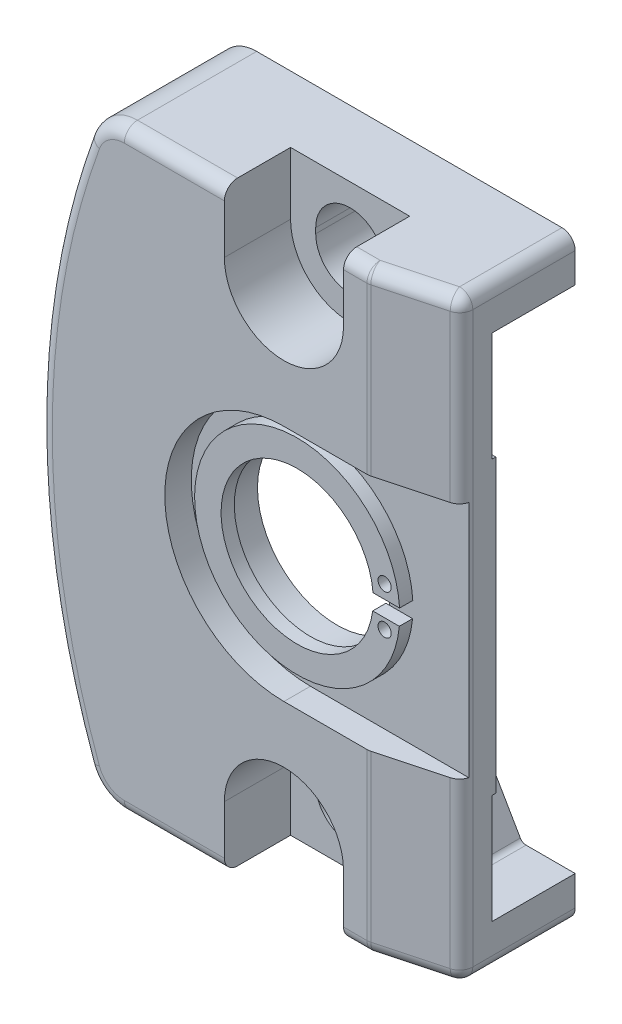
ISO-10303-21;
HEADER;
FILE_DESCRIPTION(('STEP AP214'),'2;1');
FILE_NAME('part.step','',(''),(''),'','','');
FILE_SCHEMA(('AUTOMOTIVE_DESIGN { 1 0 10303 214 1 1 1 1 }'));
ENDSEC;
DATA;
#1=APPLICATION_CONTEXT('core data for automotive mechanical design processes');
#2=APPLICATION_PROTOCOL_DEFINITION('international standard','automotive_design',2000,#1);
#3=PRODUCT_CONTEXT('',#1,'mechanical');
#4=PRODUCT('Part','Part','',(#3));
#5=PRODUCT_RELATED_PRODUCT_CATEGORY('part','',(#4));
#6=PRODUCT_DEFINITION_FORMATION('','',#4);
#7=PRODUCT_DEFINITION_CONTEXT('part definition',#1,'design');
#8=PRODUCT_DEFINITION('design','',#6,#7);
#9=PRODUCT_DEFINITION_SHAPE('','',#8);
#10=(LENGTH_UNIT() NAMED_UNIT(*) SI_UNIT(.MILLI.,.METRE.));
#11=(NAMED_UNIT(*) PLANE_ANGLE_UNIT() SI_UNIT($,.RADIAN.));
#12=(NAMED_UNIT(*) SI_UNIT($,.STERADIAN.) SOLID_ANGLE_UNIT());
#13=UNCERTAINTY_MEASURE_WITH_UNIT(LENGTH_MEASURE(1.E-05),#10,'distance_accuracy_value','');
#14=(GEOMETRIC_REPRESENTATION_CONTEXT(3) GLOBAL_UNCERTAINTY_ASSIGNED_CONTEXT((#13)) GLOBAL_UNIT_ASSIGNED_CONTEXT((#10,
#11,#12)) REPRESENTATION_CONTEXT('',''));
#15=CARTESIAN_POINT('',(0.,0.,0.));
#16=DIRECTION('',(0.,0.,1.));
#17=DIRECTION('',(1.,0.,0.));
#18=AXIS2_PLACEMENT_3D('',#15,#16,#17);
#19=CARTESIAN_POINT('',(0.,35.8,5.));
#20=DIRECTION('',(0.,0.,1.));
#21=DIRECTION('',(0.,1.,0.));
#22=AXIS2_PLACEMENT_3D('',#19,#20,#21);
#23=PLANE('',#22);
#24=DIRECTION('',(0.,-1.,0.));
#25=VECTOR('',#24,1.);
#26=CARTESIAN_POINT('',(-2.6,35.8,5.));
#27=LINE('',#26,#25);
#28=CARTESIAN_POINT('',(-2.6,36.2,5.));
#29=VERTEX_POINT('',#28);
#30=CARTESIAN_POINT('',(-2.6,35.8,5.));
#31=VERTEX_POINT('',#30);
#32=EDGE_CURVE('E647',#29,#31,#27,.T.);
#33=ORIENTED_EDGE('',*,*,#32,.F.);
#34=CARTESIAN_POINT('',(0.,36.2,5.));
#35=DIRECTION('',(0.,0.,1.));
#36=DIRECTION('',(0.,1.,0.));
#37=AXIS2_PLACEMENT_3D('',#34,#35,#36);
#38=CIRCLE('',#37,2.6);
#39=CARTESIAN_POINT('',(2.6,36.2,5.));
#40=VERTEX_POINT('',#39);
#41=EDGE_CURVE('E651',#40,#29,#38,.T.);
#42=ORIENTED_EDGE('',*,*,#41,.F.);
#43=DIRECTION('',(0.,1.,0.));
#44=VECTOR('',#43,1.);
#45=CARTESIAN_POINT('',(2.6,35.8,5.));
#46=LINE('',#45,#44);
#47=CARTESIAN_POINT('',(2.6,35.8,5.));
#48=VERTEX_POINT('',#47);
#49=EDGE_CURVE('E654',#48,#40,#46,.T.);
#50=ORIENTED_EDGE('',*,*,#49,.F.);
#51=CARTESIAN_POINT('',(0.,35.8,5.));
#52=DIRECTION('',(0.,0.,1.));
#53=DIRECTION('',(0.,1.,0.));
#54=AXIS2_PLACEMENT_3D('',#51,#52,#53);
#55=CIRCLE('',#54,2.6);
#56=EDGE_CURVE('E236',#31,#48,#55,.T.);
#57=ORIENTED_EDGE('',*,*,#56,.F.);
#58=EDGE_LOOP('',(#33,#42,#50,#57));
#59=FACE_BOUND('',#58,.T.);
#60=CARTESIAN_POINT('',(0.,35.8,5.));
#61=DIRECTION('',(0.,0.,1.));
#62=DIRECTION('',(0.,1.,0.));
#63=AXIS2_PLACEMENT_3D('',#60,#61,#62);
#64=CIRCLE('',#63,4.5);
#65=CARTESIAN_POINT('',(-4.5,35.8,5.));
#66=VERTEX_POINT('',#65);
#67=CARTESIAN_POINT('',(4.5,35.8,5.));
#68=VERTEX_POINT('',#67);
#69=EDGE_CURVE('E445',#66,#68,#64,.T.);
#70=ORIENTED_EDGE('',*,*,#69,.T.);
#71=DIRECTION('',(0.,1.,0.));
#72=VECTOR('',#71,1.);
#73=CARTESIAN_POINT('',(4.5,40.5,5.));
#74=LINE('',#73,#72);
#75=CARTESIAN_POINT('',(4.5,40.5,5.));
#76=VERTEX_POINT('',#75);
#77=EDGE_CURVE('E458',#68,#76,#74,.T.);
#78=ORIENTED_EDGE('',*,*,#77,.T.);
#79=DIRECTION('',(-1.,0.,0.));
#80=VECTOR('',#79,1.);
#81=CARTESIAN_POINT('',(-4.5,40.5,5.));
#82=LINE('',#81,#80);
#83=CARTESIAN_POINT('',(-4.5,40.5,5.));
#84=VERTEX_POINT('',#83);
#85=EDGE_CURVE('E455',#76,#84,#82,.T.);
#86=ORIENTED_EDGE('',*,*,#85,.T.);
#87=DIRECTION('',(0.,-1.,0.));
#88=VECTOR('',#87,1.);
#89=CARTESIAN_POINT('',(-4.5,35.8,5.));
#90=LINE('',#89,#88);
#91=EDGE_CURVE('E434',#84,#66,#90,.T.);
#92=ORIENTED_EDGE('',*,*,#91,.T.);
#93=EDGE_LOOP('',(#70,#78,#86,#92));
#94=FACE_BOUND('',#93,.T.);
#95=ADVANCED_FACE('F14',(#59,#94),#23,.T.);
#96=CARTESIAN_POINT('',(0.,0.2,5.));
#97=DIRECTION('',(0.,0.,-1.));
#98=DIRECTION('',(0.,-1.,0.));
#99=AXIS2_PLACEMENT_3D('',#96,#97,#98);
#100=PLANE('',#99);
#101=CARTESIAN_POINT('',(0.,-0.200000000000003,5.));
#102=DIRECTION('',(0.,0.,1.));
#103=DIRECTION('',(0.,-1.,0.));
#104=AXIS2_PLACEMENT_3D('',#101,#102,#103);
#105=CIRCLE('',#104,2.6);
#106=CARTESIAN_POINT('',(-2.6,-0.200000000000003,5.));
#107=VERTEX_POINT('',#106);
#108=CARTESIAN_POINT('',(2.6,-0.200000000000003,5.));
#109=VERTEX_POINT('',#108);
#110=EDGE_CURVE('E684',#107,#109,#105,.T.);
#111=ORIENTED_EDGE('',*,*,#110,.F.);
#112=DIRECTION('',(0.,-1.,0.));
#113=VECTOR('',#112,1.);
#114=CARTESIAN_POINT('',(-2.6,0.2,5.));
#115=LINE('',#114,#113);
#116=CARTESIAN_POINT('',(-2.6,0.2,5.));
#117=VERTEX_POINT('',#116);
#118=EDGE_CURVE('E677',#117,#107,#115,.T.);
#119=ORIENTED_EDGE('',*,*,#118,.F.);
#120=CARTESIAN_POINT('',(0.,0.2,5.));
#121=DIRECTION('',(0.,0.,1.));
#122=DIRECTION('',(0.,1.,0.));
#123=AXIS2_PLACEMENT_3D('',#120,#121,#122);
#124=CIRCLE('',#123,2.6);
#125=CARTESIAN_POINT('',(2.6,0.2,5.));
#126=VERTEX_POINT('',#125);
#127=EDGE_CURVE('E463',#126,#117,#124,.T.);
#128=ORIENTED_EDGE('',*,*,#127,.F.);
#129=DIRECTION('',(0.,1.,0.));
#130=VECTOR('',#129,1.);
#131=CARTESIAN_POINT('',(2.6,0.2,5.));
#132=LINE('',#131,#130);
#133=EDGE_CURVE('E681',#109,#126,#132,.T.);
#134=ORIENTED_EDGE('',*,*,#133,.F.);
#135=EDGE_LOOP('',(#111,#119,#128,#134));
#136=FACE_BOUND('',#135,.T.);
#137=CARTESIAN_POINT('',(0.,0.2,5.));
#138=DIRECTION('',(0.,0.,1.));
#139=DIRECTION('',(0.,-1.,0.));
#140=AXIS2_PLACEMENT_3D('',#137,#138,#139);
#141=CIRCLE('',#140,4.5);
#142=CARTESIAN_POINT('',(4.5,0.2,5.));
#143=VERTEX_POINT('',#142);
#144=CARTESIAN_POINT('',(-4.5,0.2,5.));
#145=VERTEX_POINT('',#144);
#146=EDGE_CURVE('E412',#143,#145,#141,.T.);
#147=ORIENTED_EDGE('',*,*,#146,.T.);
#148=DIRECTION('',(0.,-1.,0.));
#149=VECTOR('',#148,1.);
#150=CARTESIAN_POINT('',(-4.5,0.2,5.));
#151=LINE('',#150,#149);
#152=CARTESIAN_POINT('',(-4.5,-4.5,5.));
#153=VERTEX_POINT('',#152);
#154=EDGE_CURVE('E425',#145,#153,#151,.T.);
#155=ORIENTED_EDGE('',*,*,#154,.T.);
#156=DIRECTION('',(1.,0.,0.));
#157=VECTOR('',#156,1.);
#158=CARTESIAN_POINT('',(-4.5,-4.5,5.));
#159=LINE('',#158,#157);
#160=CARTESIAN_POINT('',(4.5,-4.5,5.));
#161=VERTEX_POINT('',#160);
#162=EDGE_CURVE('E422',#153,#161,#159,.T.);
#163=ORIENTED_EDGE('',*,*,#162,.T.);
#164=DIRECTION('',(0.,1.,0.));
#165=VECTOR('',#164,1.);
#166=CARTESIAN_POINT('',(4.5,-4.5,5.));
#167=LINE('',#166,#165);
#168=EDGE_CURVE('E400',#161,#143,#167,.T.);
#169=ORIENTED_EDGE('',*,*,#168,.T.);
#170=EDGE_LOOP('',(#147,#155,#163,#169));
#171=FACE_BOUND('',#170,.T.);
#172=ADVANCED_FACE('F1009',(#136,#171),#100,.F.);
#173=CARTESIAN_POINT('',(2.6,0.2,0.));
#174=DIRECTION('',(1.,0.,0.));
#175=DIRECTION('',(0.,1.,0.));
#176=AXIS2_PLACEMENT_3D('',#173,#174,#175);
#177=PLANE('',#176);
#178=ORIENTED_EDGE('',*,*,#133,.T.);
#179=DIRECTION('',(0.,0.,1.));
#180=VECTOR('',#179,1.);
#181=CARTESIAN_POINT('',(2.6,0.2,0.));
#182=LINE('',#181,#180);
#183=CARTESIAN_POINT('',(2.6,0.2,0.));
#184=VERTEX_POINT('',#183);
#185=EDGE_CURVE('E668',#184,#126,#182,.T.);
#186=ORIENTED_EDGE('',*,*,#185,.F.);
#187=DIRECTION('',(0.,1.,0.));
#188=VECTOR('',#187,1.);
#189=CARTESIAN_POINT('',(2.6,0.2,0.));
#190=LINE('',#189,#188);
#191=CARTESIAN_POINT('',(2.6,-0.200000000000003,0.));
#192=VERTEX_POINT('',#191);
#193=EDGE_CURVE('E689',#192,#184,#190,.T.);
#194=ORIENTED_EDGE('',*,*,#193,.F.);
#195=DIRECTION('',(0.,0.,1.));
#196=VECTOR('',#195,1.);
#197=CARTESIAN_POINT('',(2.6,-0.200000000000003,0.));
#198=LINE('',#197,#196);
#199=EDGE_CURVE('E665',#192,#109,#198,.T.);
#200=ORIENTED_EDGE('',*,*,#199,.T.);
#201=EDGE_LOOP('',(#178,#186,#194,#200));
#202=FACE_BOUND('',#201,.T.);
#203=ADVANCED_FACE('F1016',(#202),#177,.F.);
#204=CARTESIAN_POINT('',(0.,-0.200000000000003,0.));
#205=DIRECTION('',(0.,0.,1.));
#206=DIRECTION('',(0.,1.,0.));
#207=AXIS2_PLACEMENT_3D('',#204,#205,#206);
#208=CYLINDRICAL_SURFACE('',#207,2.6);
#209=ORIENTED_EDGE('',*,*,#110,.T.);
#210=ORIENTED_EDGE('',*,*,#199,.F.);
#211=CARTESIAN_POINT('',(0.,-0.200000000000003,0.));
#212=DIRECTION('',(0.,0.,1.));
#213=DIRECTION('',(0.,-1.,0.));
#214=AXIS2_PLACEMENT_3D('',#211,#212,#213);
#215=CIRCLE('',#214,2.6);
#216=CARTESIAN_POINT('',(-2.6,-0.200000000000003,0.));
#217=VERTEX_POINT('',#216);
#218=EDGE_CURVE('E680',#217,#192,#215,.T.);
#219=ORIENTED_EDGE('',*,*,#218,.F.);
#220=DIRECTION('',(0.,0.,1.));
#221=VECTOR('',#220,1.);
#222=CARTESIAN_POINT('',(-2.6,-0.200000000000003,0.));
#223=LINE('',#222,#221);
#224=EDGE_CURVE('E657',#217,#107,#223,.T.);
#225=ORIENTED_EDGE('',*,*,#224,.T.);
#226=EDGE_LOOP('',(#209,#210,#219,#225));
#227=FACE_BOUND('',#226,.T.);
#228=ADVANCED_FACE('F707',(#227),#208,.F.);
#229=CARTESIAN_POINT('',(-2.6,0.2,0.));
#230=DIRECTION('',(-1.,0.,0.));
#231=DIRECTION('',(0.,-1.,0.));
#232=AXIS2_PLACEMENT_3D('',#229,#230,#231);
#233=PLANE('',#232);
#234=ORIENTED_EDGE('',*,*,#118,.T.);
#235=ORIENTED_EDGE('',*,*,#224,.F.);
#236=DIRECTION('',(0.,-1.,0.));
#237=VECTOR('',#236,1.);
#238=CARTESIAN_POINT('',(-2.6,0.2,0.));
#239=LINE('',#238,#237);
#240=CARTESIAN_POINT('',(-2.6,0.2,0.));
#241=VERTEX_POINT('',#240);
#242=EDGE_CURVE('E669',#241,#217,#239,.T.);
#243=ORIENTED_EDGE('',*,*,#242,.F.);
#244=DIRECTION('',(0.,0.,1.));
#245=VECTOR('',#244,1.);
#246=CARTESIAN_POINT('',(-2.6,0.2,0.));
#247=LINE('',#246,#245);
#248=EDGE_CURVE('E672',#241,#117,#247,.T.);
#249=ORIENTED_EDGE('',*,*,#248,.T.);
#250=EDGE_LOOP('',(#234,#235,#243,#249));
#251=FACE_BOUND('',#250,.T.);
#252=ADVANCED_FACE('F1932',(#251),#233,.F.);
#253=CARTESIAN_POINT('',(0.,0.2,0.));
#254=DIRECTION('',(0.,0.,1.));
#255=DIRECTION('',(0.,1.,0.));
#256=AXIS2_PLACEMENT_3D('',#253,#254,#255);
#257=CYLINDRICAL_SURFACE('',#256,2.6);
#258=ORIENTED_EDGE('',*,*,#127,.T.);
#259=ORIENTED_EDGE('',*,*,#248,.F.);
#260=CARTESIAN_POINT('',(0.,0.2,0.));
#261=DIRECTION('',(0.,0.,1.));
#262=DIRECTION('',(0.,1.,0.));
#263=AXIS2_PLACEMENT_3D('',#260,#261,#262);
#264=CIRCLE('',#263,2.6);
#265=EDGE_CURVE('E452',#184,#241,#264,.T.);
#266=ORIENTED_EDGE('',*,*,#265,.F.);
#267=ORIENTED_EDGE('',*,*,#185,.T.);
#268=EDGE_LOOP('',(#258,#259,#266,#267));
#269=FACE_BOUND('',#268,.T.);
#270=ADVANCED_FACE('F1023',(#269),#257,.F.);
#271=CARTESIAN_POINT('',(-11.3,-0.75,6.3));
#272=DIRECTION('',(0.,0.,-1.));
#273=DIRECTION('',(-1.,0.,0.));
#274=AXIS2_PLACEMENT_3D('',#271,#272,#273);
#275=CYLINDRICAL_SURFACE('',#274,0.5);
#276=CARTESIAN_POINT('',(-11.3,-0.75,0.));
#277=DIRECTION('',(0.,0.,-1.));
#278=DIRECTION('',(-1.,0.,0.));
#279=AXIS2_PLACEMENT_3D('',#276,#277,#278);
#280=CIRCLE('',#279,0.5);
#281=CARTESIAN_POINT('',(-10.8,-0.75,0.));
#282=VERTEX_POINT('',#281);
#283=CARTESIAN_POINT('',(-11.3,-1.25,0.));
#284=VERTEX_POINT('',#283);
#285=EDGE_CURVE('E522',#282,#284,#280,.T.);
#286=ORIENTED_EDGE('',*,*,#285,.T.);
#287=DIRECTION('',(0.,0.,-1.));
#288=VECTOR('',#287,1.);
#289=CARTESIAN_POINT('',(-11.3,-1.25,6.3));
#290=LINE('',#289,#288);
#291=CARTESIAN_POINT('',(-11.3,-1.25,6.3));
#292=VERTEX_POINT('',#291);
#293=EDGE_CURVE('E492',#292,#284,#290,.T.);
#294=ORIENTED_EDGE('',*,*,#293,.F.);
#295=CARTESIAN_POINT('',(-11.3,-0.75,6.3));
#296=DIRECTION('',(0.,0.,-1.));
#297=DIRECTION('',(-1.,0.,0.));
#298=AXIS2_PLACEMENT_3D('',#295,#296,#297);
#299=CIRCLE('',#298,0.5);
#300=CARTESIAN_POINT('',(-10.8,-0.75,6.3));
#301=VERTEX_POINT('',#300);
#302=EDGE_CURVE('E564',#301,#292,#299,.T.);
#303=ORIENTED_EDGE('',*,*,#302,.F.);
#304=DIRECTION('',(0.,0.,-1.));
#305=VECTOR('',#304,1.);
#306=CARTESIAN_POINT('',(-10.8,-0.75,6.3));
#307=LINE('',#306,#305);
#308=EDGE_CURVE('E489',#301,#282,#307,.T.);
#309=ORIENTED_EDGE('',*,*,#308,.T.);
#310=EDGE_LOOP('',(#286,#294,#303,#309));
#311=FACE_BOUND('',#310,.T.);
#312=ADVANCED_FACE('F1728',(#311),#275,.F.);
#313=CARTESIAN_POINT('',(-10.8,-0.75,6.3));
#314=DIRECTION('',(1.,0.,0.));
#315=DIRECTION('',(0.,0.,-1.));
#316=AXIS2_PLACEMENT_3D('',#313,#314,#315);
#317=PLANE('',#316);
#318=DIRECTION('',(0.,-1.,0.));
#319=VECTOR('',#318,1.);
#320=CARTESIAN_POINT('',(-10.8,-0.75,6.3));
#321=LINE('',#320,#319);
#322=CARTESIAN_POINT('',(-10.8,5.,6.3));
#323=VERTEX_POINT('',#322);
#324=EDGE_CURVE('E567',#323,#301,#321,.T.);
#325=ORIENTED_EDGE('',*,*,#324,.F.);
#326=DIRECTION('',(0.,0.,-1.));
#327=VECTOR('',#326,1.);
#328=CARTESIAN_POINT('',(-10.8,5.,6.3));
#329=LINE('',#328,#327);
#330=CARTESIAN_POINT('',(-10.8,5.,0.));
#331=VERTEX_POINT('',#330);
#332=EDGE_CURVE('E229',#323,#331,#329,.T.);
#333=ORIENTED_EDGE('',*,*,#332,.T.);
#334=DIRECTION('',(0.,-1.,0.));
#335=VECTOR('',#334,1.);
#336=CARTESIAN_POINT('',(-10.8,-0.75,0.));
#337=LINE('',#336,#335);
#338=EDGE_CURVE('E525',#331,#282,#337,.T.);
#339=ORIENTED_EDGE('',*,*,#338,.T.);
#340=ORIENTED_EDGE('',*,*,#308,.F.);
#341=EDGE_LOOP('',(#325,#333,#339,#340));
#342=FACE_BOUND('',#341,.T.);
#343=ADVANCED_FACE('F1162',(#342),#317,.F.);
#344=CARTESIAN_POINT('',(-10.8,5.,6.3));
#345=DIRECTION('',(0.707106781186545,-0.70710678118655,0.));
#346=DIRECTION('',(0.70710678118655,0.707106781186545,0.));
#347=AXIS2_PLACEMENT_3D('',#344,#345,#346);
#348=PLANE('',#347);
#349=DIRECTION('',(0.70710678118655,0.707106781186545,0.));
#350=VECTOR('',#349,1.);
#351=CARTESIAN_POINT('',(14.6193375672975,30.4193375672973,6.3));
#352=LINE('',#351,#350);
#353=CARTESIAN_POINT('',(-9.8,6.,6.3));
#354=VERTEX_POINT('',#353);
#355=EDGE_CURVE('E211',#354,#323,#352,.F.);
#356=ORIENTED_EDGE('',*,*,#355,.F.);
#357=DIRECTION('',(0.,0.,1.));
#358=VECTOR('',#357,1.);
#359=CARTESIAN_POINT('',(-9.8,6.,6.3));
#360=LINE('',#359,#358);
#361=CARTESIAN_POINT('',(-9.8,6.,0.));
#362=VERTEX_POINT('',#361);
#363=EDGE_CURVE('E223',#362,#354,#360,.T.);
#364=ORIENTED_EDGE('',*,*,#363,.F.);
#365=DIRECTION('',(-0.70710678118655,-0.707106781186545,0.));
#366=VECTOR('',#365,1.);
#367=CARTESIAN_POINT('',(-10.8,5.,0.));
#368=LINE('',#367,#366);
#369=EDGE_CURVE('E226',#331,#362,#368,.F.);
#370=ORIENTED_EDGE('',*,*,#369,.F.);
#371=ORIENTED_EDGE('',*,*,#332,.F.);
#372=EDGE_LOOP('',(#356,#364,#370,#371));
#373=FACE_BOUND('',#372,.T.);
#374=ADVANCED_FACE('F1158',(#373),#348,.F.);
#375=CARTESIAN_POINT('',(3.81421054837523,6.,6.3));
#376=DIRECTION('',(0.,-1.,0.));
#377=DIRECTION('',(1.,0.,0.));
#378=AXIS2_PLACEMENT_3D('',#375,#376,#377);
#379=PLANE('',#378);
#380=DIRECTION('',(-1.,0.,0.));
#381=VECTOR('',#380,1.);
#382=CARTESIAN_POINT('',(3.81421054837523,6.,6.3));
#383=LINE('',#382,#381);
#384=CARTESIAN_POINT('',(3.2368602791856,6.,6.3));
#385=VERTEX_POINT('',#384);
#386=EDGE_CURVE('E570',#385,#354,#383,.T.);
#387=ORIENTED_EDGE('',*,*,#386,.F.);
#388=DIRECTION('',(0.,0.,-1.));
#389=VECTOR('',#388,1.);
#390=CARTESIAN_POINT('',(3.2368602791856,6.,6.3));
#391=LINE('',#390,#389);
#392=CARTESIAN_POINT('',(3.2368602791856,6.,0.));
#393=VERTEX_POINT('',#392);
#394=EDGE_CURVE('E205',#385,#393,#391,.T.);
#395=ORIENTED_EDGE('',*,*,#394,.T.);
#396=DIRECTION('',(-1.,0.,0.));
#397=VECTOR('',#396,1.);
#398=CARTESIAN_POINT('',(3.81421054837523,6.,0.));
#399=LINE('',#398,#397);
#400=EDGE_CURVE('E528',#393,#362,#399,.T.);
#401=ORIENTED_EDGE('',*,*,#400,.T.);
#402=ORIENTED_EDGE('',*,*,#363,.T.);
#403=EDGE_LOOP('',(#387,#395,#401,#402));
#404=FACE_BOUND('',#403,.T.);
#405=ADVANCED_FACE('F1161',(#404),#379,.F.);
#406=CARTESIAN_POINT('',(3.2368602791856,5.,6.3));
#407=DIRECTION('',(0.,0.,-1.));
#408=DIRECTION('',(-1.,0.,0.));
#409=AXIS2_PLACEMENT_3D('',#406,#407,#408);
#410=CYLINDRICAL_SURFACE('',#409,1.);
#411=CARTESIAN_POINT('',(3.2368602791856,5.,6.3));
#412=DIRECTION('',(0.,0.,1.));
#413=DIRECTION('',(1.,0.,0.));
#414=AXIS2_PLACEMENT_3D('',#411,#412,#413);
#415=CIRCLE('',#414,1.);
#416=CARTESIAN_POINT('',(4.10288568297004,5.5,6.3));
#417=VERTEX_POINT('',#416);
#418=EDGE_CURVE('E187',#417,#385,#415,.T.);
#419=ORIENTED_EDGE('',*,*,#418,.F.);
#420=DIRECTION('',(0.,0.,-1.));
#421=VECTOR('',#420,1.);
#422=CARTESIAN_POINT('',(4.10288568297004,5.5,6.3));
#423=LINE('',#422,#421);
#424=CARTESIAN_POINT('',(4.10288568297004,5.5,0.));
#425=VERTEX_POINT('',#424);
#426=EDGE_CURVE('E199',#425,#417,#423,.F.);
#427=ORIENTED_EDGE('',*,*,#426,.F.);
#428=CARTESIAN_POINT('',(3.2368602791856,5.,0.));
#429=DIRECTION('',(0.,0.,1.));
#430=DIRECTION('',(1.,0.,0.));
#431=AXIS2_PLACEMENT_3D('',#428,#429,#430);
#432=CIRCLE('',#431,1.);
#433=EDGE_CURVE('E202',#393,#425,#432,.F.);
#434=ORIENTED_EDGE('',*,*,#433,.F.);
#435=ORIENTED_EDGE('',*,*,#394,.F.);
#436=EDGE_LOOP('',(#419,#427,#434,#435));
#437=FACE_BOUND('',#436,.T.);
#438=ADVANCED_FACE('F1170',(#437),#410,.T.);
#439=CARTESIAN_POINT('',(7.85566243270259,-1.,6.3));
#440=DIRECTION('',(-0.86602540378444,-0.5,0.));
#441=DIRECTION('',(0.5,-0.86602540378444,0.));
#442=AXIS2_PLACEMENT_3D('',#439,#440,#441);
#443=PLANE('',#442);
#444=DIRECTION('',(-0.5,0.86602540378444,0.));
#445=VECTOR('',#444,1.);
#446=CARTESIAN_POINT('',(7.85566243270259,-1.,0.));
#447=LINE('',#446,#445);
#448=CARTESIAN_POINT('',(7.85566243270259,-1.,0.));
#449=VERTEX_POINT('',#448);
#450=EDGE_CURVE('E531',#449,#425,#447,.T.);
#451=ORIENTED_EDGE('',*,*,#450,.T.);
#452=ORIENTED_EDGE('',*,*,#426,.T.);
#453=DIRECTION('',(-0.5,0.86602540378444,0.));
#454=VECTOR('',#453,1.);
#455=CARTESIAN_POINT('',(7.85566243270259,-1.,6.3));
#456=LINE('',#455,#454);
#457=CARTESIAN_POINT('',(7.85566243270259,-1.,6.3));
#458=VERTEX_POINT('',#457);
#459=EDGE_CURVE('E573',#458,#417,#456,.T.);
#460=ORIENTED_EDGE('',*,*,#459,.F.);
#461=DIRECTION('',(0.,0.,-1.));
#462=VECTOR('',#461,1.);
#463=CARTESIAN_POINT('',(7.85566243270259,-1.,6.3));
#464=LINE('',#463,#462);
#465=EDGE_CURVE('E486',#458,#449,#464,.T.);
#466=ORIENTED_EDGE('',*,*,#465,.T.);
#467=EDGE_LOOP('',(#451,#452,#460,#466));
#468=FACE_BOUND('',#467,.T.);
#469=ADVANCED_FACE('F1173',(#468),#443,.F.);
#470=CARTESIAN_POINT('',(8.28867513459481,-0.75,6.3));
#471=DIRECTION('',(0.,0.,-1.));
#472=DIRECTION('',(-1.,0.,0.));
#473=AXIS2_PLACEMENT_3D('',#470,#471,#472);
#474=CYLINDRICAL_SURFACE('',#473,0.5);
#475=CARTESIAN_POINT('',(8.28867513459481,-0.75,0.));
#476=DIRECTION('',(0.,0.,-1.));
#477=DIRECTION('',(-1.,0.,0.));
#478=AXIS2_PLACEMENT_3D('',#475,#476,#477);
#479=CIRCLE('',#478,0.5);
#480=CARTESIAN_POINT('',(8.28867513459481,-1.25,0.));
#481=VERTEX_POINT('',#480);
#482=EDGE_CURVE('E534',#481,#449,#479,.T.);
#483=ORIENTED_EDGE('',*,*,#482,.T.);
#484=ORIENTED_EDGE('',*,*,#465,.F.);
#485=CARTESIAN_POINT('',(8.28867513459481,-0.75,6.3));
#486=DIRECTION('',(0.,0.,-1.));
#487=DIRECTION('',(-1.,0.,0.));
#488=AXIS2_PLACEMENT_3D('',#485,#486,#487);
#489=CIRCLE('',#488,0.5);
#490=CARTESIAN_POINT('',(8.28867513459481,-1.25,6.3));
#491=VERTEX_POINT('',#490);
#492=EDGE_CURVE('E576',#491,#458,#489,.T.);
#493=ORIENTED_EDGE('',*,*,#492,.F.);
#494=DIRECTION('',(0.,0.,-1.));
#495=VECTOR('',#494,1.);
#496=CARTESIAN_POINT('',(8.28867513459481,-1.25,6.3));
#497=LINE('',#496,#495);
#498=EDGE_CURVE('E483',#491,#481,#497,.T.);
#499=ORIENTED_EDGE('',*,*,#498,.T.);
#500=EDGE_LOOP('',(#483,#484,#493,#499));
#501=FACE_BOUND('',#500,.T.);
#502=ADVANCED_FACE('F1725',(#501),#474,.F.);
#503=CARTESIAN_POINT('',(-11.3,36.75,6.3));
#504=DIRECTION('',(0.,0.,-1.));
#505=DIRECTION('',(-1.,0.,0.));
#506=AXIS2_PLACEMENT_3D('',#503,#504,#505);
#507=CYLINDRICAL_SURFACE('',#506,0.5);
#508=CARTESIAN_POINT('',(-11.3,36.75,0.));
#509=DIRECTION('',(0.,0.,-1.));
#510=DIRECTION('',(1.,0.,0.));
#511=AXIS2_PLACEMENT_3D('',#508,#509,#510);
#512=CIRCLE('',#511,0.5);
#513=CARTESIAN_POINT('',(-11.3,37.25,0.));
#514=VERTEX_POINT('',#513);
#515=CARTESIAN_POINT('',(-10.8,36.75,0.));
#516=VERTEX_POINT('',#515);
#517=EDGE_CURVE('E513',#514,#516,#512,.T.);
#518=ORIENTED_EDGE('',*,*,#517,.T.);
#519=DIRECTION('',(0.,0.,-1.));
#520=VECTOR('',#519,1.);
#521=CARTESIAN_POINT('',(-10.8,36.75,6.3));
#522=LINE('',#521,#520);
#523=CARTESIAN_POINT('',(-10.8,36.75,6.3));
#524=VERTEX_POINT('',#523);
#525=EDGE_CURVE('E498',#524,#516,#522,.T.);
#526=ORIENTED_EDGE('',*,*,#525,.F.);
#527=CARTESIAN_POINT('',(-11.3,36.75,6.3));
#528=DIRECTION('',(0.,0.,-1.));
#529=DIRECTION('',(1.,0.,0.));
#530=AXIS2_PLACEMENT_3D('',#527,#528,#529);
#531=CIRCLE('',#530,0.5);
#532=CARTESIAN_POINT('',(-11.3,37.25,6.3));
#533=VERTEX_POINT('',#532);
#534=EDGE_CURVE('E555',#533,#524,#531,.T.);
#535=ORIENTED_EDGE('',*,*,#534,.F.);
#536=DIRECTION('',(0.,0.,-1.));
#537=VECTOR('',#536,1.);
#538=CARTESIAN_POINT('',(-11.3,37.25,6.3));
#539=LINE('',#538,#537);
#540=EDGE_CURVE('E495',#533,#514,#539,.T.);
#541=ORIENTED_EDGE('',*,*,#540,.T.);
#542=EDGE_LOOP('',(#518,#526,#535,#541));
#543=FACE_BOUND('',#542,.T.);
#544=ADVANCED_FACE('F1722',(#543),#507,.F.);
#545=CARTESIAN_POINT('',(-10.8,36.75,6.3));
#546=DIRECTION('',(1.,0.,0.));
#547=DIRECTION('',(0.,1.,0.));
#548=AXIS2_PLACEMENT_3D('',#545,#546,#547);
#549=PLANE('',#548);
#550=DIRECTION('',(0.,-1.,0.));
#551=VECTOR('',#550,1.);
#552=CARTESIAN_POINT('',(-10.8,36.75,0.));
#553=LINE('',#552,#551);
#554=CARTESIAN_POINT('',(-10.8,31.,0.));
#555=VERTEX_POINT('',#554);
#556=EDGE_CURVE('E510',#516,#555,#553,.T.);
#557=ORIENTED_EDGE('',*,*,#556,.T.);
#558=DIRECTION('',(0.,0.,1.));
#559=VECTOR('',#558,1.);
#560=CARTESIAN_POINT('',(-10.8,31.,6.3));
#561=LINE('',#560,#559);
#562=CARTESIAN_POINT('',(-10.8,31.,6.3));
#563=VERTEX_POINT('',#562);
#564=EDGE_CURVE('E214',#555,#563,#561,.T.);
#565=ORIENTED_EDGE('',*,*,#564,.T.);
#566=DIRECTION('',(0.,-1.,0.));
#567=VECTOR('',#566,1.);
#568=CARTESIAN_POINT('',(-10.8,36.75,6.3));
#569=LINE('',#568,#567);
#570=EDGE_CURVE('E552',#524,#563,#569,.T.);
#571=ORIENTED_EDGE('',*,*,#570,.F.);
#572=ORIENTED_EDGE('',*,*,#525,.T.);
#573=EDGE_LOOP('',(#557,#565,#571,#572));
#574=FACE_BOUND('',#573,.T.);
#575=ADVANCED_FACE('F1168',(#574),#549,.F.);
#576=CARTESIAN_POINT('',(-9.8,30.,6.3));
#577=DIRECTION('',(0.70710678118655,0.707106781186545,0.));
#578=DIRECTION('',(-0.707106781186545,0.70710678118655,0.));
#579=AXIS2_PLACEMENT_3D('',#576,#577,#578);
#580=PLANE('',#579);
#581=DIRECTION('',(-0.707106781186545,0.70710678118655,0.));
#582=VECTOR('',#581,1.);
#583=CARTESIAN_POINT('',(-4.13066243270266,24.3306624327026,6.3));
#584=LINE('',#583,#582);
#585=CARTESIAN_POINT('',(-9.8,30.,6.3));
#586=VERTEX_POINT('',#585);
#587=EDGE_CURVE('E208',#563,#586,#584,.F.);
#588=ORIENTED_EDGE('',*,*,#587,.F.);
#589=ORIENTED_EDGE('',*,*,#564,.F.);
#590=DIRECTION('',(0.707106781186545,-0.70710678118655,0.));
#591=VECTOR('',#590,1.);
#592=CARTESIAN_POINT('',(-9.8,30.,0.));
#593=LINE('',#592,#591);
#594=CARTESIAN_POINT('',(-9.8,30.,0.));
#595=VERTEX_POINT('',#594);
#596=EDGE_CURVE('E217',#595,#555,#593,.F.);
#597=ORIENTED_EDGE('',*,*,#596,.F.);
#598=DIRECTION('',(0.,0.,-1.));
#599=VECTOR('',#598,1.);
#600=CARTESIAN_POINT('',(-9.8,30.,6.3));
#601=LINE('',#600,#599);
#602=EDGE_CURVE('E220',#586,#595,#601,.T.);
#603=ORIENTED_EDGE('',*,*,#602,.F.);
#604=EDGE_LOOP('',(#588,#589,#597,#603));
#605=FACE_BOUND('',#604,.T.);
#606=ADVANCED_FACE('F1164',(#605),#580,.F.);
#607=CARTESIAN_POINT('',(3.81421054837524,30.,6.3));
#608=DIRECTION('',(0.,1.,0.));
#609=DIRECTION('',(-1.,0.,0.));
#610=AXIS2_PLACEMENT_3D('',#607,#608,#609);
#611=PLANE('',#610);
#612=DIRECTION('',(1.,0.,0.));
#613=VECTOR('',#612,1.);
#614=CARTESIAN_POINT('',(3.81421054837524,30.,0.));
#615=LINE('',#614,#613);
#616=CARTESIAN_POINT('',(3.23686027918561,30.,0.));
#617=VERTEX_POINT('',#616);
#618=EDGE_CURVE('E507',#595,#617,#615,.T.);
#619=ORIENTED_EDGE('',*,*,#618,.T.);
#620=DIRECTION('',(0.,0.,-1.));
#621=VECTOR('',#620,1.);
#622=CARTESIAN_POINT('',(3.23686027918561,30.,6.3));
#623=LINE('',#622,#621);
#624=CARTESIAN_POINT('',(3.23686027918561,30.,6.3));
#625=VERTEX_POINT('',#624);
#626=EDGE_CURVE('E190',#617,#625,#623,.F.);
#627=ORIENTED_EDGE('',*,*,#626,.T.);
#628=DIRECTION('',(1.,0.,0.));
#629=VECTOR('',#628,1.);
#630=CARTESIAN_POINT('',(3.81421054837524,30.,6.3));
#631=LINE('',#630,#629);
#632=EDGE_CURVE('E549',#586,#625,#631,.T.);
#633=ORIENTED_EDGE('',*,*,#632,.F.);
#634=ORIENTED_EDGE('',*,*,#602,.T.);
#635=EDGE_LOOP('',(#619,#627,#633,#634));
#636=FACE_BOUND('',#635,.T.);
#637=ADVANCED_FACE('F1167',(#636),#611,.F.);
#638=CARTESIAN_POINT('',(3.23686027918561,31.,6.3));
#639=DIRECTION('',(0.,0.,-1.));
#640=DIRECTION('',(-1.,0.,0.));
#641=AXIS2_PLACEMENT_3D('',#638,#639,#640);
#642=CYLINDRICAL_SURFACE('',#641,1.);
#643=CARTESIAN_POINT('',(3.23686027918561,31.,6.3));
#644=DIRECTION('',(0.,0.,1.));
#645=DIRECTION('',(1.,0.,0.));
#646=AXIS2_PLACEMENT_3D('',#643,#644,#645);
#647=CIRCLE('',#646,1.);
#648=CARTESIAN_POINT('',(4.10288568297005,30.5,6.3));
#649=VERTEX_POINT('',#648);
#650=EDGE_CURVE('E184',#625,#649,#647,.T.);
#651=ORIENTED_EDGE('',*,*,#650,.F.);
#652=ORIENTED_EDGE('',*,*,#626,.F.);
#653=CARTESIAN_POINT('',(3.23686027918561,31.,0.));
#654=DIRECTION('',(0.,0.,1.));
#655=DIRECTION('',(1.,0.,0.));
#656=AXIS2_PLACEMENT_3D('',#653,#654,#655);
#657=CIRCLE('',#656,1.);
#658=CARTESIAN_POINT('',(4.10288568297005,30.5,0.));
#659=VERTEX_POINT('',#658);
#660=EDGE_CURVE('E193',#659,#617,#657,.F.);
#661=ORIENTED_EDGE('',*,*,#660,.F.);
#662=DIRECTION('',(0.,0.,-1.));
#663=VECTOR('',#662,1.);
#664=CARTESIAN_POINT('',(4.10288568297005,30.5,6.3));
#665=LINE('',#664,#663);
#666=EDGE_CURVE('E196',#649,#659,#665,.T.);
#667=ORIENTED_EDGE('',*,*,#666,.F.);
#668=EDGE_LOOP('',(#651,#652,#661,#667));
#669=FACE_BOUND('',#668,.T.);
#670=ADVANCED_FACE('F1175',(#669),#642,.T.);
#671=CARTESIAN_POINT('',(7.85566243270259,37.,6.3));
#672=DIRECTION('',(-0.86602540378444,0.5,0.));
#673=DIRECTION('',(-0.5,-0.86602540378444,0.));
#674=AXIS2_PLACEMENT_3D('',#671,#672,#673);
#675=PLANE('',#674);
#676=DIRECTION('',(0.5,0.86602540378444,0.));
#677=VECTOR('',#676,1.);
#678=CARTESIAN_POINT('',(7.85566243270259,37.,6.3));
#679=LINE('',#678,#677);
#680=CARTESIAN_POINT('',(7.85566243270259,37.,6.3));
#681=VERTEX_POINT('',#680);
#682=EDGE_CURVE('E477',#649,#681,#679,.T.);
#683=ORIENTED_EDGE('',*,*,#682,.F.);
#684=ORIENTED_EDGE('',*,*,#666,.T.);
#685=DIRECTION('',(0.5,0.86602540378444,0.));
#686=VECTOR('',#685,1.);
#687=CARTESIAN_POINT('',(7.85566243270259,37.,0.));
#688=LINE('',#687,#686);
#689=CARTESIAN_POINT('',(7.85566243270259,37.,0.));
#690=VERTEX_POINT('',#689);
#691=EDGE_CURVE('E503',#659,#690,#688,.T.);
#692=ORIENTED_EDGE('',*,*,#691,.T.);
#693=DIRECTION('',(0.,0.,-1.));
#694=VECTOR('',#693,1.);
#695=CARTESIAN_POINT('',(7.85566243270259,37.,6.3));
#696=LINE('',#695,#694);
#697=EDGE_CURVE('E258',#681,#690,#696,.T.);
#698=ORIENTED_EDGE('',*,*,#697,.F.);
#699=EDGE_LOOP('',(#683,#684,#692,#698));
#700=FACE_BOUND('',#699,.T.);
#701=ADVANCED_FACE('F1178',(#700),#675,.F.);
#702=CARTESIAN_POINT('',(8.28867513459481,36.75,6.3));
#703=DIRECTION('',(0.,0.,-1.));
#704=DIRECTION('',(-1.,0.,0.));
#705=AXIS2_PLACEMENT_3D('',#702,#703,#704);
#706=CYLINDRICAL_SURFACE('',#705,0.5);
#707=CARTESIAN_POINT('',(8.28867513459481,36.75,0.));
#708=DIRECTION('',(0.,0.,-1.));
#709=DIRECTION('',(1.,0.,0.));
#710=AXIS2_PLACEMENT_3D('',#707,#708,#709);
#711=CIRCLE('',#710,0.5);
#712=CARTESIAN_POINT('',(8.28867513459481,37.25,0.));
#713=VERTEX_POINT('',#712);
#714=EDGE_CURVE('E543',#690,#713,#711,.T.);
#715=ORIENTED_EDGE('',*,*,#714,.T.);
#716=DIRECTION('',(0.,0.,-1.));
#717=VECTOR('',#716,1.);
#718=CARTESIAN_POINT('',(8.28867513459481,37.25,6.3));
#719=LINE('',#718,#717);
#720=CARTESIAN_POINT('',(8.28867513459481,37.25,6.3));
#721=VERTEX_POINT('',#720);
#722=EDGE_CURVE('E473',#721,#713,#719,.T.);
#723=ORIENTED_EDGE('',*,*,#722,.F.);
#724=CARTESIAN_POINT('',(8.28867513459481,36.75,6.3));
#725=DIRECTION('',(0.,0.,-1.));
#726=DIRECTION('',(1.,0.,0.));
#727=AXIS2_PLACEMENT_3D('',#724,#725,#726);
#728=CIRCLE('',#727,0.5);
#729=EDGE_CURVE('E506',#681,#721,#728,.T.);
#730=ORIENTED_EDGE('',*,*,#729,.F.);
#731=ORIENTED_EDGE('',*,*,#697,.T.);
#732=EDGE_LOOP('',(#715,#723,#730,#731));
#733=FACE_BOUND('',#732,.T.);
#734=ADVANCED_FACE('F1560',(#733),#706,.F.);
#735=CARTESIAN_POINT('',(2.6,35.8,0.));
#736=DIRECTION('',(1.,0.,0.));
#737=DIRECTION('',(0.,1.,0.));
#738=AXIS2_PLACEMENT_3D('',#735,#736,#737);
#739=PLANE('',#738);
#740=ORIENTED_EDGE('',*,*,#49,.T.);
#741=DIRECTION('',(0.,0.,1.));
#742=VECTOR('',#741,1.);
#743=CARTESIAN_POINT('',(2.6,36.2,0.));
#744=LINE('',#743,#742);
#745=CARTESIAN_POINT('',(2.6,36.2,0.));
#746=VERTEX_POINT('',#745);
#747=EDGE_CURVE('E638',#746,#40,#744,.T.);
#748=ORIENTED_EDGE('',*,*,#747,.F.);
#749=DIRECTION('',(0.,1.,0.));
#750=VECTOR('',#749,1.);
#751=CARTESIAN_POINT('',(2.6,35.8,0.));
#752=LINE('',#751,#750);
#753=CARTESIAN_POINT('',(2.6,35.8,0.));
#754=VERTEX_POINT('',#753);
#755=EDGE_CURVE('E650',#754,#746,#752,.T.);
#756=ORIENTED_EDGE('',*,*,#755,.F.);
#757=DIRECTION('',(0.,0.,1.));
#758=VECTOR('',#757,1.);
#759=CARTESIAN_POINT('',(2.6,35.8,0.));
#760=LINE('',#759,#758);
#761=EDGE_CURVE('E635',#754,#48,#760,.T.);
#762=ORIENTED_EDGE('',*,*,#761,.T.);
#763=EDGE_LOOP('',(#740,#748,#756,#762));
#764=FACE_BOUND('',#763,.T.);
#765=ADVANCED_FACE('F1568',(#764),#739,.F.);
#766=CARTESIAN_POINT('',(0.,35.8,0.));
#767=DIRECTION('',(0.,0.,1.));
#768=DIRECTION('',(0.,1.,0.));
#769=AXIS2_PLACEMENT_3D('',#766,#767,#768);
#770=CYLINDRICAL_SURFACE('',#769,2.6);
#771=DIRECTION('',(0.,0.,1.));
#772=VECTOR('',#771,1.);
#773=CARTESIAN_POINT('',(-2.6,35.8,0.));
#774=LINE('',#773,#772);
#775=CARTESIAN_POINT('',(-2.6,35.8,0.));
#776=VERTEX_POINT('',#775);
#777=EDGE_CURVE('E127',#776,#31,#774,.T.);
#778=ORIENTED_EDGE('',*,*,#777,.T.);
#779=ORIENTED_EDGE('',*,*,#56,.T.);
#780=ORIENTED_EDGE('',*,*,#761,.F.);
#781=CARTESIAN_POINT('',(0.,35.8,0.));
#782=DIRECTION('',(0.,0.,1.));
#783=DIRECTION('',(0.,1.,0.));
#784=AXIS2_PLACEMENT_3D('',#781,#782,#783);
#785=CIRCLE('',#784,2.6);
#786=EDGE_CURVE('E466',#776,#754,#785,.T.);
#787=ORIENTED_EDGE('',*,*,#786,.F.);
#788=EDGE_LOOP('',(#778,#779,#780,#787));
#789=FACE_BOUND('',#788,.T.);
#790=ADVANCED_FACE('F1577',(#789),#770,.F.);
#791=CARTESIAN_POINT('',(-2.6,35.8,0.));
#792=DIRECTION('',(-1.,0.,0.));
#793=DIRECTION('',(0.,-1.,0.));
#794=AXIS2_PLACEMENT_3D('',#791,#792,#793);
#795=PLANE('',#794);
#796=ORIENTED_EDGE('',*,*,#32,.T.);
#797=ORIENTED_EDGE('',*,*,#777,.F.);
#798=DIRECTION('',(0.,-1.,0.));
#799=VECTOR('',#798,1.);
#800=CARTESIAN_POINT('',(-2.6,35.8,0.));
#801=LINE('',#800,#799);
#802=CARTESIAN_POINT('',(-2.6,36.2,0.));
#803=VERTEX_POINT('',#802);
#804=EDGE_CURVE('E639',#803,#776,#801,.T.);
#805=ORIENTED_EDGE('',*,*,#804,.F.);
#806=DIRECTION('',(0.,0.,1.));
#807=VECTOR('',#806,1.);
#808=CARTESIAN_POINT('',(-2.6,36.2,0.));
#809=LINE('',#808,#807);
#810=EDGE_CURVE('E642',#803,#29,#809,.T.);
#811=ORIENTED_EDGE('',*,*,#810,.T.);
#812=EDGE_LOOP('',(#796,#797,#805,#811));
#813=FACE_BOUND('',#812,.T.);
#814=ADVANCED_FACE('F1586',(#813),#795,.F.);
#815=CARTESIAN_POINT('',(0.,36.2,0.));
#816=DIRECTION('',(0.,0.,1.));
#817=DIRECTION('',(0.,1.,0.));
#818=AXIS2_PLACEMENT_3D('',#815,#816,#817);
#819=CYLINDRICAL_SURFACE('',#818,2.6);
#820=ORIENTED_EDGE('',*,*,#41,.T.);
#821=ORIENTED_EDGE('',*,*,#810,.F.);
#822=CARTESIAN_POINT('',(0.,36.2,0.));
#823=DIRECTION('',(0.,0.,1.));
#824=DIRECTION('',(0.,1.,0.));
#825=AXIS2_PLACEMENT_3D('',#822,#823,#824);
#826=CIRCLE('',#825,2.6);
#827=EDGE_CURVE('E660',#746,#803,#826,.T.);
#828=ORIENTED_EDGE('',*,*,#827,.F.);
#829=ORIENTED_EDGE('',*,*,#747,.T.);
#830=EDGE_LOOP('',(#820,#821,#828,#829));
#831=FACE_BOUND('',#830,.T.);
#832=ADVANCED_FACE('F1079',(#831),#819,.F.);
#833=CARTESIAN_POINT('',(-16.,40.5,10.));
#834=DIRECTION('',(0.,1.,0.));
#835=DIRECTION('',(-1.,0.,0.));
#836=AXIS2_PLACEMENT_3D('',#833,#834,#835);
#837=PLANE('',#836);
#838=DIRECTION('',(0.,0.,-1.));
#839=VECTOR('',#838,1.);
#840=CARTESIAN_POINT('',(-12.0607132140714,40.5,10.));
#841=LINE('',#840,#839);
#842=CARTESIAN_POINT('',(-12.0607132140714,40.5,0.));
#843=VERTEX_POINT('',#842);
#844=CARTESIAN_POINT('',(-12.0607132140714,40.5,9.));
#845=VERTEX_POINT('',#844);
#846=EDGE_CURVE('E166',#843,#845,#841,.F.);
#847=ORIENTED_EDGE('',*,*,#846,.T.);
#848=DIRECTION('',(1.,0.,0.));
#849=VECTOR('',#848,1.);
#850=CARTESIAN_POINT('',(-4.5,40.5,9.));
#851=LINE('',#850,#849);
#852=CARTESIAN_POINT('',(-4.5,40.5,9.));
#853=VERTEX_POINT('',#852);
#854=EDGE_CURVE('E130',#845,#853,#851,.T.);
#855=ORIENTED_EDGE('',*,*,#854,.T.);
#856=DIRECTION('',(0.,0.,1.));
#857=VECTOR('',#856,1.);
#858=CARTESIAN_POINT('',(-4.5,40.5,5.));
#859=LINE('',#858,#857);
#860=EDGE_CURVE('E437',#84,#853,#859,.T.);
#861=ORIENTED_EDGE('',*,*,#860,.F.);
#862=ORIENTED_EDGE('',*,*,#85,.F.);
#863=DIRECTION('',(0.,0.,1.));
#864=VECTOR('',#863,1.);
#865=CARTESIAN_POINT('',(4.5,40.5,5.));
#866=LINE('',#865,#864);
#867=CARTESIAN_POINT('',(4.5,40.5,9.));
#868=VERTEX_POINT('',#867);
#869=EDGE_CURVE('E433',#76,#868,#866,.T.);
#870=ORIENTED_EDGE('',*,*,#869,.T.);
#871=DIRECTION('',(1.,0.,0.));
#872=VECTOR('',#871,1.);
#873=CARTESIAN_POINT('',(6.2702712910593,40.5,9.));
#874=LINE('',#873,#872);
#875=CARTESIAN_POINT('',(6.2702712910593,40.5,9.));
#876=VERTEX_POINT('',#875);
#877=EDGE_CURVE('E285',#868,#876,#874,.T.);
#878=ORIENTED_EDGE('',*,*,#877,.T.);
#879=DIRECTION('',(0.965925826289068,0.,-0.258819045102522));
#880=VECTOR('',#879,1.);
#881=CARTESIAN_POINT('',(10.7411809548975,40.5,7.80202336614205));
#882=LINE('',#881,#880);
#883=CARTESIAN_POINT('',(11.,40.5,7.73267301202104));
#884=VERTEX_POINT('',#883);
#885=EDGE_CURVE('E288',#876,#884,#882,.T.);
#886=ORIENTED_EDGE('',*,*,#885,.T.);
#887=DIRECTION('',(0.,0.,-1.));
#888=VECTOR('',#887,1.);
#889=CARTESIAN_POINT('',(11.,40.5,0.));
#890=LINE('',#889,#888);
#891=CARTESIAN_POINT('',(11.,40.5,0.));
#892=VERTEX_POINT('',#891);
#893=EDGE_CURVE('E336',#884,#892,#890,.T.);
#894=ORIENTED_EDGE('',*,*,#893,.T.);
#895=DIRECTION('',(-1.,0.,0.));
#896=VECTOR('',#895,1.);
#897=CARTESIAN_POINT('',(-16.,40.5,0.));
#898=LINE('',#897,#896);
#899=EDGE_CURVE('E361',#892,#843,#898,.T.);
#900=ORIENTED_EDGE('',*,*,#899,.T.);
#901=EDGE_LOOP('',(#847,#855,#861,#862,#870,#878,#886,#894,#900));
#902=FACE_BOUND('',#901,.T.);
#903=ADVANCED_FACE('F1075',(#902),#837,.T.);
#904=CARTESIAN_POINT('',(-16.,-4.5,10.));
#905=DIRECTION('',(0.,1.,0.));
#906=DIRECTION('',(-1.,0.,0.));
#907=AXIS2_PLACEMENT_3D('',#904,#905,#906);
#908=PLANE('',#907);
#909=DIRECTION('',(0.,0.,1.));
#910=VECTOR('',#909,1.);
#911=CARTESIAN_POINT('',(-4.5,-4.5,5.));
#912=LINE('',#911,#910);
#913=CARTESIAN_POINT('',(-4.5,-4.5,9.));
#914=VERTEX_POINT('',#913);
#915=EDGE_CURVE('E399',#153,#914,#912,.T.);
#916=ORIENTED_EDGE('',*,*,#915,.T.);
#917=DIRECTION('',(1.,0.,0.));
#918=VECTOR('',#917,1.);
#919=CARTESIAN_POINT('',(-16.,-4.5,9.));
#920=LINE('',#919,#918);
#921=CARTESIAN_POINT('',(-12.0607132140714,-4.5,9.));
#922=VERTEX_POINT('',#921);
#923=EDGE_CURVE('E142',#914,#922,#920,.F.);
#924=ORIENTED_EDGE('',*,*,#923,.T.);
#925=DIRECTION('',(0.,0.,1.));
#926=VECTOR('',#925,1.);
#927=CARTESIAN_POINT('',(-12.0607132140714,-4.5,10.));
#928=LINE('',#927,#926);
#929=CARTESIAN_POINT('',(-12.0607132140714,-4.5,0.));
#930=VERTEX_POINT('',#929);
#931=EDGE_CURVE('E172',#922,#930,#928,.F.);
#932=ORIENTED_EDGE('',*,*,#931,.T.);
#933=DIRECTION('',(-1.,0.,0.));
#934=VECTOR('',#933,1.);
#935=CARTESIAN_POINT('',(-16.,-4.5,0.));
#936=LINE('',#935,#934);
#937=CARTESIAN_POINT('',(11.,-4.5,0.));
#938=VERTEX_POINT('',#937);
#939=EDGE_CURVE('E358',#938,#930,#936,.T.);
#940=ORIENTED_EDGE('',*,*,#939,.F.);
#941=DIRECTION('',(0.,0.,-1.));
#942=VECTOR('',#941,1.);
#943=CARTESIAN_POINT('',(11.,-4.5,10.));
#944=LINE('',#943,#942);
#945=CARTESIAN_POINT('',(11.,-4.5,7.73267301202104));
#946=VERTEX_POINT('',#945);
#947=EDGE_CURVE('E339',#938,#946,#944,.F.);
#948=ORIENTED_EDGE('',*,*,#947,.T.);
#949=DIRECTION('',(0.965925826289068,0.,-0.258819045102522));
#950=VECTOR('',#949,1.);
#951=CARTESIAN_POINT('',(-14.7581746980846,-4.5,14.6345551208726));
#952=LINE('',#951,#950);
#953=CARTESIAN_POINT('',(6.2702712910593,-4.5,9.));
#954=VERTEX_POINT('',#953);
#955=EDGE_CURVE('E309',#946,#954,#952,.F.);
#956=ORIENTED_EDGE('',*,*,#955,.T.);
#957=DIRECTION('',(1.,0.,0.));
#958=VECTOR('',#957,1.);
#959=CARTESIAN_POINT('',(-16.,-4.5,9.));
#960=LINE('',#959,#958);
#961=CARTESIAN_POINT('',(4.5,-4.5,9.));
#962=VERTEX_POINT('',#961);
#963=EDGE_CURVE('E306',#954,#962,#960,.F.);
#964=ORIENTED_EDGE('',*,*,#963,.T.);
#965=DIRECTION('',(0.,0.,1.));
#966=VECTOR('',#965,1.);
#967=CARTESIAN_POINT('',(4.5,-4.5,5.));
#968=LINE('',#967,#966);
#969=EDGE_CURVE('E403',#161,#962,#968,.T.);
#970=ORIENTED_EDGE('',*,*,#969,.F.);
#971=ORIENTED_EDGE('',*,*,#162,.F.);
#972=EDGE_LOOP('',(#916,#924,#932,#940,#948,#956,#964,#970,#971));
#973=FACE_BOUND('',#972,.T.);
#974=ADVANCED_FACE('F1078',(#973),#908,.F.);
#975=CARTESIAN_POINT('',(6.2702712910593,39.5,9.));
#976=DIRECTION('',(0.,1.,0.));
#977=DIRECTION('',(-1.,0.,0.));
#978=AXIS2_PLACEMENT_3D('',#975,#976,#977);
#979=SPHERICAL_SURFACE('',#978,1.);
#980=CARTESIAN_POINT('',(6.2702712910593,39.5,9.));
#981=DIRECTION('',(1.,0.,0.));
#982=DIRECTION('',(0.,1.,0.));
#983=AXIS2_PLACEMENT_3D('',#980,#981,#982);
#984=CIRCLE('',#983,1.);
#985=CARTESIAN_POINT('',(6.2702712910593,39.5,10.));
#986=VERTEX_POINT('',#985);
#987=EDGE_CURVE('E233',#876,#986,#984,.T.);
#988=ORIENTED_EDGE('',*,*,#987,.T.);
#989=CARTESIAN_POINT('',(6.2702712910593,39.5,9.));
#990=DIRECTION('',(0.,-1.,0.));
#991=DIRECTION('',(1.,0.,0.));
#992=AXIS2_PLACEMENT_3D('',#989,#990,#991);
#993=CIRCLE('',#992,1.);
#994=CARTESIAN_POINT('',(6.52909033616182,39.5,9.96592582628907));
#995=VERTEX_POINT('',#994);
#996=EDGE_CURVE('E279',#995,#986,#993,.T.);
#997=ORIENTED_EDGE('',*,*,#996,.F.);
#998=CARTESIAN_POINT('',(6.2702712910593,39.5,9.));
#999=DIRECTION('',(0.965925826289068,0.,-0.258819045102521));
#1000=DIRECTION('',(-0.258819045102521,0.,-0.965925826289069));
#1001=AXIS2_PLACEMENT_3D('',#998,#999,#1000);
#1002=CIRCLE('',#1001,1.);
#1003=EDGE_CURVE('E237',#876,#995,#1002,.T.);
#1004=ORIENTED_EDGE('',*,*,#1003,.F.);
#1005=EDGE_LOOP('',(#988,#997,#1004));
#1006=FACE_BOUND('',#1005,.T.);
#1007=ADVANCED_FACE('F1083',(#1006),#979,.T.);
#1008=CARTESIAN_POINT('',(-14.7581746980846,39.5,14.6345551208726));
#1009=DIRECTION('',(-0.965925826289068,0.,0.258819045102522));
#1010=DIRECTION('',(0.258819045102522,0.,0.965925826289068));
#1011=AXIS2_PLACEMENT_3D('',#1008,#1009,#1010);
#1012=CYLINDRICAL_SURFACE('',#1011,1.);
#1013=CARTESIAN_POINT('',(11.,39.5,7.73267301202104));
#1014=DIRECTION('',(0.965925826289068,0.,-0.258819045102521));
#1015=DIRECTION('',(-0.258819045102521,0.,-0.965925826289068));
#1016=AXIS2_PLACEMENT_3D('',#1013,#1014,#1015);
#1017=CIRCLE('',#1016,1.);
#1018=CARTESIAN_POINT('',(11.2588190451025,39.5,8.69859883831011));
#1019=VERTEX_POINT('',#1018);
#1020=EDGE_CURVE('E240',#884,#1019,#1017,.T.);
#1021=ORIENTED_EDGE('',*,*,#1020,.F.);
#1022=ORIENTED_EDGE('',*,*,#885,.F.);
#1023=ORIENTED_EDGE('',*,*,#1003,.T.);
#1024=DIRECTION('',(0.965925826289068,0.,-0.258819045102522));
#1025=VECTOR('',#1024,1.);
#1026=CARTESIAN_POINT('',(6.52909033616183,39.5,9.96592582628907));
#1027=LINE('',#1026,#1025);
#1028=EDGE_CURVE('E273',#1019,#995,#1027,.F.);
#1029=ORIENTED_EDGE('',*,*,#1028,.F.);
#1030=EDGE_LOOP('',(#1021,#1022,#1023,#1029));
#1031=FACE_BOUND('',#1030,.T.);
#1032=ADVANCED_FACE('F1133',(#1031),#1012,.T.);
#1033=CARTESIAN_POINT('',(6.2702712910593,-3.5,9.));
#1034=DIRECTION('',(0.,1.,0.));
#1035=DIRECTION('',(-1.,0.,0.));
#1036=AXIS2_PLACEMENT_3D('',#1033,#1034,#1035);
#1037=SPHERICAL_SURFACE('',#1036,1.);
#1038=CARTESIAN_POINT('',(6.2702712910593,-3.5,9.));
#1039=DIRECTION('',(-0.965925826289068,0.,0.258819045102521));
#1040=DIRECTION('',(0.258819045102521,0.,0.965925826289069));
#1041=AXIS2_PLACEMENT_3D('',#1038,#1039,#1040);
#1042=CIRCLE('',#1041,1.);
#1043=CARTESIAN_POINT('',(6.52909033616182,-3.5,9.96592582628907));
#1044=VERTEX_POINT('',#1043);
#1045=EDGE_CURVE('E252',#954,#1044,#1042,.T.);
#1046=ORIENTED_EDGE('',*,*,#1045,.T.);
#1047=CARTESIAN_POINT('',(6.2702712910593,-3.5,9.));
#1048=DIRECTION('',(0.,-1.,0.));
#1049=DIRECTION('',(1.,0.,0.));
#1050=AXIS2_PLACEMENT_3D('',#1047,#1048,#1049);
#1051=CIRCLE('',#1050,1.);
#1052=CARTESIAN_POINT('',(6.2702712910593,-3.5,10.));
#1053=VERTEX_POINT('',#1052);
#1054=EDGE_CURVE('E300',#1053,#1044,#1051,.F.);
#1055=ORIENTED_EDGE('',*,*,#1054,.F.);
#1056=CARTESIAN_POINT('',(6.2702712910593,-3.5,9.));
#1057=DIRECTION('',(-1.,0.,0.));
#1058=DIRECTION('',(0.,-1.,0.));
#1059=AXIS2_PLACEMENT_3D('',#1056,#1057,#1058);
#1060=CIRCLE('',#1059,1.);
#1061=EDGE_CURVE('E255',#954,#1053,#1060,.T.);
#1062=ORIENTED_EDGE('',*,*,#1061,.F.);
#1063=EDGE_LOOP('',(#1046,#1055,#1062));
#1064=FACE_BOUND('',#1063,.T.);
#1065=ADVANCED_FACE('F1129',(#1064),#1037,.T.);
#1066=CARTESIAN_POINT('',(-12.0607132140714,37.5,9.));
#1067=DIRECTION('',(0.,0.,-1.));
#1068=DIRECTION('',(0.,-1.,0.));
#1069=AXIS2_PLACEMENT_3D('',#1066,#1067,#1068);
#1070=TOROIDAL_SURFACE('',#1069,2.,1.);
#1071=CARTESIAN_POINT('',(-12.0607132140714,39.5,9.));
#1072=DIRECTION('',(-1.,0.,0.));
#1073=DIRECTION('',(0.,-1.,0.));
#1074=AXIS2_PLACEMENT_3D('',#1071,#1072,#1073);
#1075=CIRCLE('',#1074,1.);
#1076=CARTESIAN_POINT('',(-12.0607132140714,39.5,10.));
#1077=VERTEX_POINT('',#1076);
#1078=EDGE_CURVE('E114',#1077,#845,#1075,.T.);
#1079=ORIENTED_EDGE('',*,*,#1078,.T.);
#1080=CARTESIAN_POINT('',(-12.0607132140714,37.5,9.));
#1081=DIRECTION('',(0.,0.,-1.));
#1082=DIRECTION('',(0.,-1.,0.));
#1083=AXIS2_PLACEMENT_3D('',#1080,#1081,#1082);
#1084=CIRCLE('',#1083,3.);
#1085=CARTESIAN_POINT('',(-14.8796981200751,38.5263157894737,9.));
#1086=VERTEX_POINT('',#1085);
#1087=EDGE_CURVE('E133',#1086,#845,#1084,.T.);
#1088=ORIENTED_EDGE('',*,*,#1087,.F.);
#1089=CARTESIAN_POINT('',(-13.9400364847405,38.1842105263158,9.));
#1090=DIRECTION('',(-0.342105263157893,-0.939661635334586,0.));
#1091=DIRECTION('',(0.939661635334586,-0.342105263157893,0.));
#1092=AXIS2_PLACEMENT_3D('',#1089,#1090,#1091);
#1093=CIRCLE('',#1092,1.);
#1094=CARTESIAN_POINT('',(-13.9400364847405,38.1842105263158,10.));
#1095=VERTEX_POINT('',#1094);
#1096=EDGE_CURVE('E118',#1095,#1086,#1093,.T.);
#1097=ORIENTED_EDGE('',*,*,#1096,.F.);
#1098=CARTESIAN_POINT('',(-12.0607132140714,37.5,10.));
#1099=DIRECTION('',(0.,0.,-1.));
#1100=DIRECTION('',(0.,-1.,0.));
#1101=AXIS2_PLACEMENT_3D('',#1098,#1099,#1100);
#1102=CIRCLE('',#1101,2.);
#1103=EDGE_CURVE('E157',#1077,#1095,#1102,.F.);
#1104=ORIENTED_EDGE('',*,*,#1103,.F.);
#1105=EDGE_LOOP('',(#1079,#1088,#1097,#1104));
#1106=FACE_BOUND('',#1105,.T.);
#1107=ADVANCED_FACE('F1132',(#1106),#1070,.T.);
#1108=CARTESIAN_POINT('',(-16.,39.5,9.));
#1109=DIRECTION('',(-1.,0.,0.));
#1110=DIRECTION('',(0.,-1.,0.));
#1111=AXIS2_PLACEMENT_3D('',#1108,#1109,#1110);
#1112=CYLINDRICAL_SURFACE('',#1111,1.);
#1113=CARTESIAN_POINT('',(-4.5,39.5,9.));
#1114=DIRECTION('',(-1.,0.,0.));
#1115=DIRECTION('',(0.,-1.,0.));
#1116=AXIS2_PLACEMENT_3D('',#1113,#1114,#1115);
#1117=CIRCLE('',#1116,1.);
#1118=CARTESIAN_POINT('',(-4.5,39.5,10.));
#1119=VERTEX_POINT('',#1118);
#1120=EDGE_CURVE('E113',#853,#1119,#1117,.F.);
#1121=ORIENTED_EDGE('',*,*,#1120,.F.);
#1122=ORIENTED_EDGE('',*,*,#854,.F.);
#1123=ORIENTED_EDGE('',*,*,#1078,.F.);
#1124=DIRECTION('',(1.,0.,0.));
#1125=VECTOR('',#1124,1.);
#1126=CARTESIAN_POINT('',(-12.0607132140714,39.5,10.));
#1127=LINE('',#1126,#1125);
#1128=EDGE_CURVE('E160',#1119,#1077,#1127,.F.);
#1129=ORIENTED_EDGE('',*,*,#1128,.F.);
#1130=EDGE_LOOP('',(#1121,#1122,#1123,#1129));
#1131=FACE_BOUND('',#1130,.T.);
#1132=ADVANCED_FACE('F1029',(#1131),#1112,.T.);
#1133=CARTESIAN_POINT('',(-4.5,35.8,5.));
#1134=DIRECTION('',(-1.,0.,0.));
#1135=DIRECTION('',(0.,-1.,0.));
#1136=AXIS2_PLACEMENT_3D('',#1133,#1134,#1135);
#1137=PLANE('',#1136);
#1138=ORIENTED_EDGE('',*,*,#860,.T.);
#1139=ORIENTED_EDGE('',*,*,#1120,.T.);
#1140=DIRECTION('',(0.,-1.,0.));
#1141=VECTOR('',#1140,1.);
#1142=CARTESIAN_POINT('',(-4.5,35.8,10.));
#1143=LINE('',#1142,#1141);
#1144=CARTESIAN_POINT('',(-4.5,35.8,10.));
#1145=VERTEX_POINT('',#1144);
#1146=EDGE_CURVE('E442',#1119,#1145,#1143,.T.);
#1147=ORIENTED_EDGE('',*,*,#1146,.T.);
#1148=DIRECTION('',(0.,0.,1.));
#1149=VECTOR('',#1148,1.);
#1150=CARTESIAN_POINT('',(-4.5,35.8,5.));
#1151=LINE('',#1150,#1149);
#1152=EDGE_CURVE('E419',#66,#1145,#1151,.T.);
#1153=ORIENTED_EDGE('',*,*,#1152,.F.);
#1154=ORIENTED_EDGE('',*,*,#91,.F.);
#1155=EDGE_LOOP('',(#1138,#1139,#1147,#1153,#1154));
#1156=FACE_BOUND('',#1155,.T.);
#1157=ADVANCED_FACE('F1025',(#1156),#1137,.F.);
#1158=CARTESIAN_POINT('',(0.,35.8,5.));
#1159=DIRECTION('',(0.,0.,1.));
#1160=DIRECTION('',(0.,1.,0.));
#1161=AXIS2_PLACEMENT_3D('',#1158,#1159,#1160);
#1162=CYLINDRICAL_SURFACE('',#1161,4.5);
#1163=CARTESIAN_POINT('',(0.,35.8,10.));
#1164=DIRECTION('',(0.,0.,1.));
#1165=DIRECTION('',(0.,1.,0.));
#1166=AXIS2_PLACEMENT_3D('',#1163,#1164,#1165);
#1167=CIRCLE('',#1166,4.5);
#1168=CARTESIAN_POINT('',(4.5,35.8,10.));
#1169=VERTEX_POINT('',#1168);
#1170=EDGE_CURVE('E449',#1145,#1169,#1167,.T.);
#1171=ORIENTED_EDGE('',*,*,#1170,.T.);
#1172=DIRECTION('',(0.,0.,1.));
#1173=VECTOR('',#1172,1.);
#1174=CARTESIAN_POINT('',(4.5,35.8,5.));
#1175=LINE('',#1174,#1173);
#1176=EDGE_CURVE('E430',#68,#1169,#1175,.T.);
#1177=ORIENTED_EDGE('',*,*,#1176,.F.);
#1178=ORIENTED_EDGE('',*,*,#69,.F.);
#1179=ORIENTED_EDGE('',*,*,#1152,.T.);
#1180=EDGE_LOOP('',(#1171,#1177,#1178,#1179));
#1181=FACE_BOUND('',#1180,.T.);
#1182=ADVANCED_FACE('F1028',(#1181),#1162,.F.);
#1183=CARTESIAN_POINT('',(4.5,40.5,5.));
#1184=DIRECTION('',(1.,0.,0.));
#1185=DIRECTION('',(0.,1.,0.));
#1186=AXIS2_PLACEMENT_3D('',#1183,#1184,#1185);
#1187=PLANE('',#1186);
#1188=DIRECTION('',(0.,1.,0.));
#1189=VECTOR('',#1188,1.);
#1190=CARTESIAN_POINT('',(4.5,40.5,10.));
#1191=LINE('',#1190,#1189);
#1192=CARTESIAN_POINT('',(4.5,39.5,10.));
#1193=VERTEX_POINT('',#1192);
#1194=EDGE_CURVE('E446',#1169,#1193,#1191,.T.);
#1195=ORIENTED_EDGE('',*,*,#1194,.T.);
#1196=CARTESIAN_POINT('',(4.5,39.5,9.));
#1197=DIRECTION('',(1.,0.,0.));
#1198=DIRECTION('',(0.,1.,0.));
#1199=AXIS2_PLACEMENT_3D('',#1196,#1197,#1198);
#1200=CIRCLE('',#1199,1.);
#1201=EDGE_CURVE('E282',#1193,#868,#1200,.F.);
#1202=ORIENTED_EDGE('',*,*,#1201,.T.);
#1203=ORIENTED_EDGE('',*,*,#869,.F.);
#1204=ORIENTED_EDGE('',*,*,#77,.F.);
#1205=ORIENTED_EDGE('',*,*,#1176,.T.);
#1206=EDGE_LOOP('',(#1195,#1202,#1203,#1204,#1205));
#1207=FACE_BOUND('',#1206,.T.);
#1208=ADVANCED_FACE('F1031',(#1207),#1187,.F.);
#1209=CARTESIAN_POINT('',(-16.,39.5,9.));
#1210=DIRECTION('',(-1.,0.,0.));
#1211=DIRECTION('',(0.,-1.,0.));
#1212=AXIS2_PLACEMENT_3D('',#1209,#1210,#1211);
#1213=CYLINDRICAL_SURFACE('',#1212,1.);
#1214=ORIENTED_EDGE('',*,*,#1201,.F.);
#1215=DIRECTION('',(1.,0.,0.));
#1216=VECTOR('',#1215,1.);
#1217=CARTESIAN_POINT('',(4.5,39.5,10.));
#1218=LINE('',#1217,#1216);
#1219=EDGE_CURVE('E315',#986,#1193,#1218,.F.);
#1220=ORIENTED_EDGE('',*,*,#1219,.F.);
#1221=ORIENTED_EDGE('',*,*,#987,.F.);
#1222=ORIENTED_EDGE('',*,*,#877,.F.);
#1223=EDGE_LOOP('',(#1214,#1220,#1221,#1222));
#1224=FACE_BOUND('',#1223,.T.);
#1225=ADVANCED_FACE('F1034',(#1224),#1213,.T.);
#1226=CARTESIAN_POINT('',(6.4019237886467,-3.5,9.));
#1227=DIRECTION('',(1.,0.,0.));
#1228=DIRECTION('',(0.,1.,0.));
#1229=AXIS2_PLACEMENT_3D('',#1226,#1227,#1228);
#1230=CYLINDRICAL_SURFACE('',#1229,1.);
#1231=CARTESIAN_POINT('',(4.5,-3.5,9.));
#1232=DIRECTION('',(1.,0.,0.));
#1233=DIRECTION('',(0.,1.,0.));
#1234=AXIS2_PLACEMENT_3D('',#1231,#1232,#1233);
#1235=CIRCLE('',#1234,1.);
#1236=CARTESIAN_POINT('',(4.5,-3.5,10.));
#1237=VERTEX_POINT('',#1236);
#1238=EDGE_CURVE('E303',#962,#1237,#1235,.F.);
#1239=ORIENTED_EDGE('',*,*,#1238,.F.);
#1240=ORIENTED_EDGE('',*,*,#963,.F.);
#1241=ORIENTED_EDGE('',*,*,#1061,.T.);
#1242=DIRECTION('',(1.,0.,0.));
#1243=VECTOR('',#1242,1.);
#1244=CARTESIAN_POINT('',(6.4019237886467,-3.5,10.));
#1245=LINE('',#1244,#1243);
#1246=EDGE_CURVE('E312',#1237,#1053,#1245,.T.);
#1247=ORIENTED_EDGE('',*,*,#1246,.F.);
#1248=EDGE_LOOP('',(#1239,#1240,#1241,#1247));
#1249=FACE_BOUND('',#1248,.T.);
#1250=ADVANCED_FACE('F1043',(#1249),#1230,.T.);
#1251=CARTESIAN_POINT('',(4.5,-4.5,5.));
#1252=DIRECTION('',(1.,0.,0.));
#1253=DIRECTION('',(0.,1.,0.));
#1254=AXIS2_PLACEMENT_3D('',#1251,#1252,#1253);
#1255=PLANE('',#1254);
#1256=ORIENTED_EDGE('',*,*,#969,.T.);
#1257=ORIENTED_EDGE('',*,*,#1238,.T.);
#1258=DIRECTION('',(0.,1.,0.));
#1259=VECTOR('',#1258,1.);
#1260=CARTESIAN_POINT('',(4.5,-4.5,10.));
#1261=LINE('',#1260,#1259);
#1262=CARTESIAN_POINT('',(4.5,0.2,10.));
#1263=VERTEX_POINT('',#1262);
#1264=EDGE_CURVE('E409',#1237,#1263,#1261,.T.);
#1265=ORIENTED_EDGE('',*,*,#1264,.T.);
#1266=DIRECTION('',(0.,0.,1.));
#1267=VECTOR('',#1266,1.);
#1268=CARTESIAN_POINT('',(4.5,0.2,5.));
#1269=LINE('',#1268,#1267);
#1270=EDGE_CURVE('E406',#143,#1263,#1269,.T.);
#1271=ORIENTED_EDGE('',*,*,#1270,.F.);
#1272=ORIENTED_EDGE('',*,*,#168,.F.);
#1273=EDGE_LOOP('',(#1256,#1257,#1265,#1271,#1272));
#1274=FACE_BOUND('',#1273,.T.);
#1275=ADVANCED_FACE('F1039',(#1274),#1255,.F.);
#1276=CARTESIAN_POINT('',(0.,0.2,5.));
#1277=DIRECTION('',(0.,0.,1.));
#1278=DIRECTION('',(0.,1.,0.));
#1279=AXIS2_PLACEMENT_3D('',#1276,#1277,#1278);
#1280=CYLINDRICAL_SURFACE('',#1279,4.5);
#1281=CARTESIAN_POINT('',(0.,0.2,10.));
#1282=DIRECTION('',(0.,0.,1.));
#1283=DIRECTION('',(0.,-1.,0.));
#1284=AXIS2_PLACEMENT_3D('',#1281,#1282,#1283);
#1285=CIRCLE('',#1284,4.5);
#1286=CARTESIAN_POINT('',(-4.5,0.2,10.));
#1287=VERTEX_POINT('',#1286);
#1288=EDGE_CURVE('E416',#1263,#1287,#1285,.T.);
#1289=ORIENTED_EDGE('',*,*,#1288,.T.);
#1290=DIRECTION('',(0.,0.,1.));
#1291=VECTOR('',#1290,1.);
#1292=CARTESIAN_POINT('',(-4.5,0.2,5.));
#1293=LINE('',#1292,#1291);
#1294=EDGE_CURVE('E396',#145,#1287,#1293,.T.);
#1295=ORIENTED_EDGE('',*,*,#1294,.F.);
#1296=ORIENTED_EDGE('',*,*,#146,.F.);
#1297=ORIENTED_EDGE('',*,*,#1270,.T.);
#1298=EDGE_LOOP('',(#1289,#1295,#1296,#1297));
#1299=FACE_BOUND('',#1298,.T.);
#1300=ADVANCED_FACE('F1042',(#1299),#1280,.F.);
#1301=CARTESIAN_POINT('',(-4.5,0.2,5.));
#1302=DIRECTION('',(-1.,0.,0.));
#1303=DIRECTION('',(0.,-1.,0.));
#1304=AXIS2_PLACEMENT_3D('',#1301,#1302,#1303);
#1305=PLANE('',#1304);
#1306=DIRECTION('',(0.,-1.,0.));
#1307=VECTOR('',#1306,1.);
#1308=CARTESIAN_POINT('',(-4.5,0.2,10.));
#1309=LINE('',#1308,#1307);
#1310=CARTESIAN_POINT('',(-4.5,-3.5,10.));
#1311=VERTEX_POINT('',#1310);
#1312=EDGE_CURVE('E413',#1287,#1311,#1309,.T.);
#1313=ORIENTED_EDGE('',*,*,#1312,.T.);
#1314=CARTESIAN_POINT('',(-4.5,-3.5,9.));
#1315=DIRECTION('',(-1.,0.,0.));
#1316=DIRECTION('',(0.,-1.,0.));
#1317=AXIS2_PLACEMENT_3D('',#1314,#1315,#1316);
#1318=CIRCLE('',#1317,1.);
#1319=EDGE_CURVE('E145',#1311,#914,#1318,.F.);
#1320=ORIENTED_EDGE('',*,*,#1319,.T.);
#1321=ORIENTED_EDGE('',*,*,#915,.F.);
#1322=ORIENTED_EDGE('',*,*,#154,.F.);
#1323=ORIENTED_EDGE('',*,*,#1294,.T.);
#1324=EDGE_LOOP('',(#1313,#1320,#1321,#1322,#1323));
#1325=FACE_BOUND('',#1324,.T.);
#1326=ADVANCED_FACE('F1045',(#1325),#1305,.F.);
#1327=CARTESIAN_POINT('',(6.4019237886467,-3.5,9.));
#1328=DIRECTION('',(1.,0.,0.));
#1329=DIRECTION('',(0.,1.,0.));
#1330=AXIS2_PLACEMENT_3D('',#1327,#1328,#1329);
#1331=CYLINDRICAL_SURFACE('',#1330,1.);
#1332=CARTESIAN_POINT('',(-12.0607132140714,-3.5,9.));
#1333=DIRECTION('',(1.,0.,0.));
#1334=DIRECTION('',(0.,1.,0.));
#1335=AXIS2_PLACEMENT_3D('',#1332,#1333,#1334);
#1336=CIRCLE('',#1335,1.);
#1337=CARTESIAN_POINT('',(-12.0607132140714,-3.5,10.));
#1338=VERTEX_POINT('',#1337);
#1339=EDGE_CURVE('E124',#1338,#922,#1336,.T.);
#1340=ORIENTED_EDGE('',*,*,#1339,.T.);
#1341=ORIENTED_EDGE('',*,*,#923,.F.);
#1342=ORIENTED_EDGE('',*,*,#1319,.F.);
#1343=DIRECTION('',(1.,0.,0.));
#1344=VECTOR('',#1343,1.);
#1345=CARTESIAN_POINT('',(6.4019237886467,-3.5,10.));
#1346=LINE('',#1345,#1344);
#1347=EDGE_CURVE('E148',#1338,#1311,#1346,.T.);
#1348=ORIENTED_EDGE('',*,*,#1347,.F.);
#1349=EDGE_LOOP('',(#1340,#1341,#1342,#1348));
#1350=FACE_BOUND('',#1349,.T.);
#1351=ADVANCED_FACE('F1048',(#1350),#1331,.T.);
#1352=CARTESIAN_POINT('',(-12.0607132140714,-1.5,9.));
#1353=DIRECTION('',(0.,0.,-1.));
#1354=DIRECTION('',(0.,-1.,0.));
#1355=AXIS2_PLACEMENT_3D('',#1352,#1353,#1354);
#1356=TOROIDAL_SURFACE('',#1355,2.,1.);
#1357=CARTESIAN_POINT('',(-13.9400364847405,-2.1842105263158,9.));
#1358=DIRECTION('',(0.342105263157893,-0.939661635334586,0.));
#1359=DIRECTION('',(0.939661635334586,0.342105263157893,0.));
#1360=AXIS2_PLACEMENT_3D('',#1357,#1358,#1359);
#1361=CIRCLE('',#1360,1.);
#1362=CARTESIAN_POINT('',(-13.9400364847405,-2.1842105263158,10.));
#1363=VERTEX_POINT('',#1362);
#1364=CARTESIAN_POINT('',(-14.8796981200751,-2.5263157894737,9.));
#1365=VERTEX_POINT('',#1364);
#1366=EDGE_CURVE('E121',#1363,#1365,#1361,.T.);
#1367=ORIENTED_EDGE('',*,*,#1366,.T.);
#1368=CARTESIAN_POINT('',(-12.0607132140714,-1.5,9.));
#1369=DIRECTION('',(0.,0.,-1.));
#1370=DIRECTION('',(0.,-1.,0.));
#1371=AXIS2_PLACEMENT_3D('',#1368,#1369,#1370);
#1372=CIRCLE('',#1371,3.);
#1373=EDGE_CURVE('E139',#922,#1365,#1372,.T.);
#1374=ORIENTED_EDGE('',*,*,#1373,.F.);
#1375=ORIENTED_EDGE('',*,*,#1339,.F.);
#1376=CARTESIAN_POINT('',(-12.0607132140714,-1.5,10.));
#1377=DIRECTION('',(0.,0.,-1.));
#1378=DIRECTION('',(0.,-1.,0.));
#1379=AXIS2_PLACEMENT_3D('',#1376,#1377,#1378);
#1380=CIRCLE('',#1379,2.);
#1381=EDGE_CURVE('E151',#1363,#1338,#1380,.F.);
#1382=ORIENTED_EDGE('',*,*,#1381,.F.);
#1383=EDGE_LOOP('',(#1367,#1374,#1375,#1382));
#1384=FACE_BOUND('',#1383,.T.);
#1385=ADVANCED_FACE('F1137',(#1384),#1356,.T.);
#1386=CARTESIAN_POINT('',(11.7411809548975,-3.5,7.53407417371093));
#1387=DIRECTION('',(0.965925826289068,0.,-0.258819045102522));
#1388=DIRECTION('',(-0.258819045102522,0.,-0.965925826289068));
#1389=AXIS2_PLACEMENT_3D('',#1386,#1387,#1388);
#1390=CYLINDRICAL_SURFACE('',#1389,1.);
#1391=CARTESIAN_POINT('',(11.,-3.5,7.73267301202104));
#1392=DIRECTION('',(-0.965925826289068,0.,0.258819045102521));
#1393=DIRECTION('',(0.258819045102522,0.,0.965925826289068));
#1394=AXIS2_PLACEMENT_3D('',#1391,#1392,#1393);
#1395=CIRCLE('',#1394,1.);
#1396=CARTESIAN_POINT('',(11.2588190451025,-3.5,8.69859883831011));
#1397=VERTEX_POINT('',#1396);
#1398=EDGE_CURVE('E249',#946,#1397,#1395,.T.);
#1399=ORIENTED_EDGE('',*,*,#1398,.T.);
#1400=DIRECTION('',(0.965925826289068,0.,-0.258819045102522));
#1401=VECTOR('',#1400,1.);
#1402=CARTESIAN_POINT('',(12.,-3.5,8.5));
#1403=LINE('',#1402,#1401);
#1404=EDGE_CURVE('E294',#1044,#1397,#1403,.T.);
#1405=ORIENTED_EDGE('',*,*,#1404,.F.);
#1406=ORIENTED_EDGE('',*,*,#1045,.F.);
#1407=ORIENTED_EDGE('',*,*,#955,.F.);
#1408=EDGE_LOOP('',(#1399,#1405,#1406,#1407));
#1409=FACE_BOUND('',#1408,.T.);
#1410=ADVANCED_FACE('F1111',(#1409),#1390,.T.);
#1411=CARTESIAN_POINT('',(11.,-3.5,0.));
#1412=DIRECTION('',(0.,0.,-1.));
#1413=DIRECTION('',(0.,-1.,0.));
#1414=AXIS2_PLACEMENT_3D('',#1411,#1412,#1413);
#1415=CYLINDRICAL_SURFACE('',#1414,1.);
#1416=DIRECTION('',(0.,0.,-1.));
#1417=VECTOR('',#1416,1.);
#1418=CARTESIAN_POINT('',(12.,-3.5,0.));
#1419=LINE('',#1418,#1417);
#1420=CARTESIAN_POINT('',(12.,-3.5,7.73267301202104));
#1421=VERTEX_POINT('',#1420);
#1422=CARTESIAN_POINT('',(12.,-3.5,0.));
#1423=VERTEX_POINT('',#1422);
#1424=EDGE_CURVE('E348',#1421,#1423,#1419,.T.);
#1425=ORIENTED_EDGE('',*,*,#1424,.F.);
#1426=CARTESIAN_POINT('',(11.,-3.5,7.73267301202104));
#1427=DIRECTION('',(0.,0.,-1.));
#1428=DIRECTION('',(0.,-1.,0.));
#1429=AXIS2_PLACEMENT_3D('',#1426,#1427,#1428);
#1430=CIRCLE('',#1429,1.);
#1431=EDGE_CURVE('E291',#1421,#946,#1430,.T.);
#1432=ORIENTED_EDGE('',*,*,#1431,.T.);
#1433=ORIENTED_EDGE('',*,*,#947,.F.);
#1434=CARTESIAN_POINT('',(11.,-3.5,0.));
#1435=DIRECTION('',(0.,0.,1.));
#1436=DIRECTION('',(1.,0.,0.));
#1437=AXIS2_PLACEMENT_3D('',#1434,#1435,#1436);
#1438=CIRCLE('',#1437,1.);
#1439=EDGE_CURVE('E342',#1423,#938,#1438,.F.);
#1440=ORIENTED_EDGE('',*,*,#1439,.F.);
#1441=EDGE_LOOP('',(#1425,#1432,#1433,#1440));
#1442=FACE_BOUND('',#1441,.T.);
#1443=ADVANCED_FACE('F1107',(#1442),#1415,.T.);
#1444=CARTESIAN_POINT('',(11.,39.5,10.));
#1445=DIRECTION('',(0.,0.,1.));
#1446=DIRECTION('',(0.,1.,0.));
#1447=AXIS2_PLACEMENT_3D('',#1444,#1445,#1446);
#1448=CYLINDRICAL_SURFACE('',#1447,1.);
#1449=ORIENTED_EDGE('',*,*,#893,.F.);
#1450=CARTESIAN_POINT('',(11.,39.5,7.73267301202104));
#1451=DIRECTION('',(0.,0.,1.));
#1452=DIRECTION('',(0.,1.,0.));
#1453=AXIS2_PLACEMENT_3D('',#1450,#1451,#1452);
#1454=CIRCLE('',#1453,1.);
#1455=CARTESIAN_POINT('',(12.,39.5,7.73267301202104));
#1456=VERTEX_POINT('',#1455);
#1457=EDGE_CURVE('E270',#884,#1456,#1454,.F.);
#1458=ORIENTED_EDGE('',*,*,#1457,.T.);
#1459=DIRECTION('',(0.,0.,-1.));
#1460=VECTOR('',#1459,1.);
#1461=CARTESIAN_POINT('',(12.,39.5,8.5));
#1462=LINE('',#1461,#1460);
#1463=CARTESIAN_POINT('',(12.,39.5,0.));
#1464=VERTEX_POINT('',#1463);
#1465=EDGE_CURVE('E351',#1464,#1456,#1462,.F.);
#1466=ORIENTED_EDGE('',*,*,#1465,.F.);
#1467=CARTESIAN_POINT('',(11.,39.5,0.));
#1468=DIRECTION('',(0.,0.,1.));
#1469=DIRECTION('',(1.,0.,0.));
#1470=AXIS2_PLACEMENT_3D('',#1467,#1468,#1469);
#1471=CIRCLE('',#1470,1.);
#1472=EDGE_CURVE('E345',#892,#1464,#1471,.F.);
#1473=ORIENTED_EDGE('',*,*,#1472,.F.);
#1474=EDGE_LOOP('',(#1449,#1458,#1466,#1473));
#1475=FACE_BOUND('',#1474,.T.);
#1476=ADVANCED_FACE('F1110',(#1475),#1448,.T.);
#1477=CARTESIAN_POINT('',(12.,37.25,6.3));
#1478=DIRECTION('',(0.,1.,0.));
#1479=DIRECTION('',(-1.,0.,0.));
#1480=AXIS2_PLACEMENT_3D('',#1477,#1478,#1479);
#1481=PLANE('',#1480);
#1482=DIRECTION('',(1.,0.,0.));
#1483=VECTOR('',#1482,1.);
#1484=CARTESIAN_POINT('',(12.,37.25,0.));
#1485=LINE('',#1484,#1483);
#1486=CARTESIAN_POINT('',(12.,37.25,0.));
#1487=VERTEX_POINT('',#1486);
#1488=EDGE_CURVE('E540',#713,#1487,#1485,.T.);
#1489=ORIENTED_EDGE('',*,*,#1488,.T.);
#1490=DIRECTION('',(0.,0.,-1.));
#1491=VECTOR('',#1490,1.);
#1492=CARTESIAN_POINT('',(12.,37.25,6.3));
#1493=LINE('',#1492,#1491);
#1494=CARTESIAN_POINT('',(12.,37.25,6.3));
#1495=VERTEX_POINT('',#1494);
#1496=EDGE_CURVE('E476',#1495,#1487,#1493,.T.);
#1497=ORIENTED_EDGE('',*,*,#1496,.F.);
#1498=DIRECTION('',(1.,0.,0.));
#1499=VECTOR('',#1498,1.);
#1500=CARTESIAN_POINT('',(12.,37.25,6.3));
#1501=LINE('',#1500,#1499);
#1502=EDGE_CURVE('E586',#721,#1495,#1501,.T.);
#1503=ORIENTED_EDGE('',*,*,#1502,.F.);
#1504=ORIENTED_EDGE('',*,*,#722,.T.);
#1505=EDGE_LOOP('',(#1489,#1497,#1503,#1504));
#1506=FACE_BOUND('',#1505,.T.);
#1507=ADVANCED_FACE('F1115',(#1506),#1481,.F.);
#1508=CARTESIAN_POINT('',(12.,-1.25,6.3));
#1509=DIRECTION('',(0.,-1.,0.));
#1510=DIRECTION('',(1.,0.,0.));
#1511=AXIS2_PLACEMENT_3D('',#1508,#1509,#1510);
#1512=PLANE('',#1511);
#1513=DIRECTION('',(-1.,0.,0.));
#1514=VECTOR('',#1513,1.);
#1515=CARTESIAN_POINT('',(12.,-1.25,0.));
#1516=LINE('',#1515,#1514);
#1517=CARTESIAN_POINT('',(12.,-1.25,0.));
#1518=VERTEX_POINT('',#1517);
#1519=EDGE_CURVE('E537',#1518,#481,#1516,.T.);
#1520=ORIENTED_EDGE('',*,*,#1519,.T.);
#1521=ORIENTED_EDGE('',*,*,#498,.F.);
#1522=DIRECTION('',(-1.,0.,0.));
#1523=VECTOR('',#1522,1.);
#1524=CARTESIAN_POINT('',(12.,-1.25,6.3));
#1525=LINE('',#1524,#1523);
#1526=CARTESIAN_POINT('',(12.,-1.25,6.3));
#1527=VERTEX_POINT('',#1526);
#1528=EDGE_CURVE('E579',#1527,#491,#1525,.T.);
#1529=ORIENTED_EDGE('',*,*,#1528,.F.);
#1530=DIRECTION('',(0.,0.,-1.));
#1531=VECTOR('',#1530,1.);
#1532=CARTESIAN_POINT('',(12.,-1.25,6.3));
#1533=LINE('',#1532,#1531);
#1534=EDGE_CURVE('E480',#1527,#1518,#1533,.T.);
#1535=ORIENTED_EDGE('',*,*,#1534,.T.);
#1536=EDGE_LOOP('',(#1520,#1521,#1529,#1535));
#1537=FACE_BOUND('',#1536,.T.);
#1538=ADVANCED_FACE('F1607',(#1537),#1512,.F.);
#1539=CARTESIAN_POINT('',(-16.,40.5,0.));
#1540=DIRECTION('',(0.,0.,1.));
#1541=DIRECTION('',(1.,0.,0.));
#1542=AXIS2_PLACEMENT_3D('',#1539,#1540,#1541);
#1543=PLANE('',#1542);
#1544=ORIENTED_EDGE('',*,*,#265,.T.);
#1545=ORIENTED_EDGE('',*,*,#242,.T.);
#1546=ORIENTED_EDGE('',*,*,#218,.T.);
#1547=ORIENTED_EDGE('',*,*,#193,.T.);
#1548=EDGE_LOOP('',(#1544,#1545,#1546,#1547));
#1549=FACE_BOUND('',#1548,.T.);
#1550=ORIENTED_EDGE('',*,*,#939,.T.);
#1551=CARTESIAN_POINT('',(-12.0607132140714,-1.5,0.));
#1552=DIRECTION('',(0.,0.,1.));
#1553=DIRECTION('',(1.,0.,0.));
#1554=AXIS2_PLACEMENT_3D('',#1551,#1552,#1553);
#1555=CIRCLE('',#1554,3.);
#1556=CARTESIAN_POINT('',(-14.8796981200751,-2.5263157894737,0.));
#1557=VERTEX_POINT('',#1556);
#1558=EDGE_CURVE('E169',#930,#1557,#1555,.F.);
#1559=ORIENTED_EDGE('',*,*,#1558,.T.);
#1560=CARTESIAN_POINT('',(41.5,18.,0.));
#1561=DIRECTION('',(0.,0.,-1.));
#1562=DIRECTION('',(0.,-1.,0.));
#1563=AXIS2_PLACEMENT_3D('',#1560,#1561,#1562);
#1564=CIRCLE('',#1563,60.);
#1565=CARTESIAN_POINT('',(-15.3281400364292,-1.25,0.));
#1566=VERTEX_POINT('',#1565);
#1567=EDGE_CURVE('E632',#1557,#1566,#1564,.T.);
#1568=ORIENTED_EDGE('',*,*,#1567,.T.);
#1569=DIRECTION('',(-1.,0.,0.));
#1570=VECTOR('',#1569,1.);
#1571=CARTESIAN_POINT('',(-16.,-1.25,0.));
#1572=LINE('',#1571,#1570);
#1573=EDGE_CURVE('E519',#284,#1566,#1572,.T.);
#1574=ORIENTED_EDGE('',*,*,#1573,.F.);
#1575=ORIENTED_EDGE('',*,*,#285,.F.);
#1576=ORIENTED_EDGE('',*,*,#338,.F.);
#1577=ORIENTED_EDGE('',*,*,#369,.T.);
#1578=ORIENTED_EDGE('',*,*,#400,.F.);
#1579=ORIENTED_EDGE('',*,*,#433,.T.);
#1580=ORIENTED_EDGE('',*,*,#450,.F.);
#1581=ORIENTED_EDGE('',*,*,#482,.F.);
#1582=ORIENTED_EDGE('',*,*,#1519,.F.);
#1583=DIRECTION('',(0.,-1.,0.));
#1584=VECTOR('',#1583,1.);
#1585=CARTESIAN_POINT('',(12.,40.5,0.));
#1586=LINE('',#1585,#1584);
#1587=EDGE_CURVE('E357',#1518,#1423,#1586,.T.);
#1588=ORIENTED_EDGE('',*,*,#1587,.T.);
#1589=ORIENTED_EDGE('',*,*,#1439,.T.);
#1590=EDGE_LOOP('',(#1550,#1559,#1568,#1574,#1575,#1576,#1577,#1578,#1579,#1580,#1581,#1582,
#1588,#1589));
#1591=FACE_BOUND('',#1590,.T.);
#1592=ADVANCED_FACE('F696',(#1549,#1591),#1543,.F.);
#1593=CARTESIAN_POINT('',(-16.,-1.25,6.3));
#1594=DIRECTION('',(0.,-1.,0.));
#1595=DIRECTION('',(1.,0.,0.));
#1596=AXIS2_PLACEMENT_3D('',#1593,#1594,#1595);
#1597=PLANE('',#1596);
#1598=ORIENTED_EDGE('',*,*,#1573,.T.);
#1599=DIRECTION('',(0.,0.,1.));
#1600=VECTOR('',#1599,1.);
#1601=CARTESIAN_POINT('',(-15.3281400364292,-1.25,0.));
#1602=LINE('',#1601,#1600);
#1603=CARTESIAN_POINT('',(-15.3281400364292,-1.25,6.3));
#1604=VERTEX_POINT('',#1603);
#1605=EDGE_CURVE('E614',#1566,#1604,#1602,.T.);
#1606=ORIENTED_EDGE('',*,*,#1605,.T.);
#1607=DIRECTION('',(-1.,0.,0.));
#1608=VECTOR('',#1607,1.);
#1609=CARTESIAN_POINT('',(-16.,-1.25,6.3));
#1610=LINE('',#1609,#1608);
#1611=EDGE_CURVE('E561',#292,#1604,#1610,.T.);
#1612=ORIENTED_EDGE('',*,*,#1611,.F.);
#1613=ORIENTED_EDGE('',*,*,#293,.T.);
#1614=EDGE_LOOP('',(#1598,#1606,#1612,#1613));
#1615=FACE_BOUND('',#1614,.T.);
#1616=ADVANCED_FACE('F1626',(#1615),#1597,.F.);
#1617=CARTESIAN_POINT('',(8.28867513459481,36.75,6.3));
#1618=DIRECTION('',(0.,0.,1.));
#1619=DIRECTION('',(1.,0.,0.));
#1620=AXIS2_PLACEMENT_3D('',#1617,#1618,#1619);
#1621=PLANE('',#1620);
#1622=ORIENTED_EDGE('',*,*,#1611,.T.);
#1623=CARTESIAN_POINT('',(41.5,18.,6.3));
#1624=DIRECTION('',(0.,0.,1.));
#1625=DIRECTION('',(1.,0.,0.));
#1626=AXIS2_PLACEMENT_3D('',#1623,#1624,#1625);
#1627=CIRCLE('',#1626,60.);
#1628=CARTESIAN_POINT('',(-17.4830484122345,7.,6.3));
#1629=VERTEX_POINT('',#1628);
#1630=EDGE_CURVE('E617',#1604,#1629,#1627,.F.);
#1631=ORIENTED_EDGE('',*,*,#1630,.T.);
#1632=DIRECTION('',(-1.,0.,0.));
#1633=VECTOR('',#1632,1.);
#1634=CARTESIAN_POINT('',(12.,7.,6.3));
#1635=LINE('',#1634,#1633);
#1636=CARTESIAN_POINT('',(12.,7.,6.3));
#1637=VERTEX_POINT('',#1636);
#1638=EDGE_CURVE('E601',#1637,#1629,#1635,.T.);
#1639=ORIENTED_EDGE('',*,*,#1638,.F.);
#1640=DIRECTION('',(0.,-1.,0.));
#1641=VECTOR('',#1640,1.);
#1642=CARTESIAN_POINT('',(12.,37.25,6.3));
#1643=LINE('',#1642,#1641);
#1644=EDGE_CURVE('E585',#1637,#1527,#1643,.T.);
#1645=ORIENTED_EDGE('',*,*,#1644,.T.);
#1646=ORIENTED_EDGE('',*,*,#1528,.T.);
#1647=ORIENTED_EDGE('',*,*,#492,.T.);
#1648=ORIENTED_EDGE('',*,*,#459,.T.);
#1649=ORIENTED_EDGE('',*,*,#418,.T.);
#1650=ORIENTED_EDGE('',*,*,#386,.T.);
#1651=ORIENTED_EDGE('',*,*,#355,.T.);
#1652=ORIENTED_EDGE('',*,*,#324,.T.);
#1653=ORIENTED_EDGE('',*,*,#302,.T.);
#1654=EDGE_LOOP('',(#1622,#1631,#1639,#1645,#1646,#1647,#1648,#1649,#1650,#1651,#1652,#1653));
#1655=FACE_BOUND('',#1654,.T.);
#1656=ADVANCED_FACE('F1634',(#1655),#1621,.F.);
#1657=DIRECTION('',(1.,0.,0.));
#1658=VECTOR('',#1657,1.);
#1659=CARTESIAN_POINT('',(12.,29.,6.3));
#1660=LINE('',#1659,#1658);
#1661=CARTESIAN_POINT('',(-17.4830484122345,29.,6.3));
#1662=VERTEX_POINT('',#1661);
#1663=CARTESIAN_POINT('',(12.,29.,6.3));
#1664=VERTEX_POINT('',#1663);
#1665=EDGE_CURVE('E597',#1662,#1664,#1660,.T.);
#1666=ORIENTED_EDGE('',*,*,#1665,.F.);
#1667=CARTESIAN_POINT('',(41.5,18.,6.3));
#1668=DIRECTION('',(0.,0.,1.));
#1669=DIRECTION('',(1.,0.,0.));
#1670=AXIS2_PLACEMENT_3D('',#1667,#1668,#1669);
#1671=CIRCLE('',#1670,60.);
#1672=CARTESIAN_POINT('',(-15.3281400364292,37.25,6.3));
#1673=VERTEX_POINT('',#1672);
#1674=EDGE_CURVE('E626',#1662,#1673,#1671,.F.);
#1675=ORIENTED_EDGE('',*,*,#1674,.T.);
#1676=DIRECTION('',(1.,0.,0.));
#1677=VECTOR('',#1676,1.);
#1678=CARTESIAN_POINT('',(-16.,37.25,6.3));
#1679=LINE('',#1678,#1677);
#1680=EDGE_CURVE('E558',#1673,#533,#1679,.T.);
#1681=ORIENTED_EDGE('',*,*,#1680,.T.);
#1682=ORIENTED_EDGE('',*,*,#534,.T.);
#1683=ORIENTED_EDGE('',*,*,#570,.T.);
#1684=ORIENTED_EDGE('',*,*,#587,.T.);
#1685=ORIENTED_EDGE('',*,*,#632,.T.);
#1686=ORIENTED_EDGE('',*,*,#650,.T.);
#1687=ORIENTED_EDGE('',*,*,#682,.T.);
#1688=ORIENTED_EDGE('',*,*,#729,.T.);
#1689=ORIENTED_EDGE('',*,*,#1502,.T.);
#1690=EDGE_CURVE('E582',#1495,#1664,#1643,.T.);
#1691=ORIENTED_EDGE('',*,*,#1690,.T.);
#1692=EDGE_LOOP('',(#1666,#1675,#1681,#1682,#1683,#1684,#1685,#1686,#1687,#1688,#1689,#1691));
#1693=FACE_BOUND('',#1692,.T.);
#1694=ADVANCED_FACE('F1644',(#1693),#1621,.F.);
#1695=CARTESIAN_POINT('',(-16.,37.25,6.3));
#1696=DIRECTION('',(0.,1.,0.));
#1697=DIRECTION('',(-1.,0.,0.));
#1698=AXIS2_PLACEMENT_3D('',#1695,#1696,#1697);
#1699=PLANE('',#1698);
#1700=ORIENTED_EDGE('',*,*,#1680,.F.);
#1701=DIRECTION('',(0.,0.,1.));
#1702=VECTOR('',#1701,1.);
#1703=CARTESIAN_POINT('',(-15.3281400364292,37.25,0.));
#1704=LINE('',#1703,#1702);
#1705=CARTESIAN_POINT('',(-15.3281400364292,37.25,0.));
#1706=VERTEX_POINT('',#1705);
#1707=EDGE_CURVE('E620',#1673,#1706,#1704,.F.);
#1708=ORIENTED_EDGE('',*,*,#1707,.T.);
#1709=DIRECTION('',(1.,0.,0.));
#1710=VECTOR('',#1709,1.);
#1711=CARTESIAN_POINT('',(-16.,37.25,0.));
#1712=LINE('',#1711,#1710);
#1713=EDGE_CURVE('E516',#1706,#514,#1712,.T.);
#1714=ORIENTED_EDGE('',*,*,#1713,.T.);
#1715=ORIENTED_EDGE('',*,*,#540,.F.);
#1716=EDGE_LOOP('',(#1700,#1708,#1714,#1715));
#1717=FACE_BOUND('',#1716,.T.);
#1718=ADVANCED_FACE('F1089',(#1717),#1699,.F.);
#1719=ORIENTED_EDGE('',*,*,#827,.T.);
#1720=ORIENTED_EDGE('',*,*,#804,.T.);
#1721=ORIENTED_EDGE('',*,*,#786,.T.);
#1722=ORIENTED_EDGE('',*,*,#755,.T.);
#1723=EDGE_LOOP('',(#1719,#1720,#1721,#1722));
#1724=FACE_BOUND('',#1723,.T.);
#1725=CARTESIAN_POINT('',(-14.8796981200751,38.5263157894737,0.));
#1726=VERTEX_POINT('',#1725);
#1727=EDGE_CURVE('E117',#1706,#1726,#1564,.T.);
#1728=ORIENTED_EDGE('',*,*,#1727,.T.);
#1729=CARTESIAN_POINT('',(-12.0607132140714,37.5,0.));
#1730=DIRECTION('',(0.,0.,1.));
#1731=DIRECTION('',(1.,0.,0.));
#1732=AXIS2_PLACEMENT_3D('',#1729,#1730,#1731);
#1733=CIRCLE('',#1732,3.);
#1734=EDGE_CURVE('E163',#1726,#843,#1733,.F.);
#1735=ORIENTED_EDGE('',*,*,#1734,.T.);
#1736=ORIENTED_EDGE('',*,*,#899,.F.);
#1737=ORIENTED_EDGE('',*,*,#1472,.T.);
#1738=EDGE_CURVE('E354',#1464,#1487,#1586,.T.);
#1739=ORIENTED_EDGE('',*,*,#1738,.T.);
#1740=ORIENTED_EDGE('',*,*,#1488,.F.);
#1741=ORIENTED_EDGE('',*,*,#714,.F.);
#1742=ORIENTED_EDGE('',*,*,#691,.F.);
#1743=ORIENTED_EDGE('',*,*,#660,.T.);
#1744=ORIENTED_EDGE('',*,*,#618,.F.);
#1745=ORIENTED_EDGE('',*,*,#596,.T.);
#1746=ORIENTED_EDGE('',*,*,#556,.F.);
#1747=ORIENTED_EDGE('',*,*,#517,.F.);
#1748=ORIENTED_EDGE('',*,*,#1713,.F.);
#1749=EDGE_LOOP('',(#1728,#1735,#1736,#1737,#1739,#1740,#1741,#1742,#1743,#1744,#1745,#1746,
#1747,#1748));
#1750=FACE_BOUND('',#1749,.T.);
#1751=ADVANCED_FACE('F1085',(#1724,#1750),#1543,.F.);
#1752=CARTESIAN_POINT('',(-12.0607132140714,37.5,0.));
#1753=DIRECTION('',(0.,0.,1.));
#1754=DIRECTION('',(0.,1.,0.));
#1755=AXIS2_PLACEMENT_3D('',#1752,#1753,#1754);
#1756=CYLINDRICAL_SURFACE('',#1755,3.);
#1757=DIRECTION('',(0.,0.,1.));
#1758=VECTOR('',#1757,1.);
#1759=CARTESIAN_POINT('',(-14.8796981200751,38.5263157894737,0.));
#1760=LINE('',#1759,#1758);
#1761=EDGE_CURVE('E178',#1086,#1726,#1760,.F.);
#1762=ORIENTED_EDGE('',*,*,#1761,.F.);
#1763=ORIENTED_EDGE('',*,*,#1087,.T.);
#1764=ORIENTED_EDGE('',*,*,#846,.F.);
#1765=ORIENTED_EDGE('',*,*,#1734,.F.);
#1766=EDGE_LOOP('',(#1762,#1763,#1764,#1765));
#1767=FACE_BOUND('',#1766,.T.);
#1768=ADVANCED_FACE('F1088',(#1767),#1756,.T.);
#1769=CARTESIAN_POINT('',(41.5,18.,9.));
#1770=DIRECTION('',(0.,0.,-1.));
#1771=DIRECTION('',(0.,-1.,0.));
#1772=AXIS2_PLACEMENT_3D('',#1769,#1770,#1771);
#1773=TOROIDAL_SURFACE('',#1772,59.,1.);
#1774=ORIENTED_EDGE('',*,*,#1096,.T.);
#1775=CARTESIAN_POINT('',(41.5,18.,9.));
#1776=DIRECTION('',(0.,0.,-1.));
#1777=DIRECTION('',(0.,-1.,0.));
#1778=AXIS2_PLACEMENT_3D('',#1775,#1776,#1777);
#1779=CIRCLE('',#1778,60.);
#1780=EDGE_CURVE('E136',#1365,#1086,#1779,.T.);
#1781=ORIENTED_EDGE('',*,*,#1780,.F.);
#1782=ORIENTED_EDGE('',*,*,#1366,.F.);
#1783=CARTESIAN_POINT('',(41.5,18.,10.));
#1784=DIRECTION('',(0.,0.,-1.));
#1785=DIRECTION('',(0.,-1.,0.));
#1786=AXIS2_PLACEMENT_3D('',#1783,#1784,#1785);
#1787=CIRCLE('',#1786,59.);
#1788=EDGE_CURVE('E154',#1095,#1363,#1787,.F.);
#1789=ORIENTED_EDGE('',*,*,#1788,.F.);
#1790=EDGE_LOOP('',(#1774,#1781,#1782,#1789));
#1791=FACE_BOUND('',#1790,.T.);
#1792=ADVANCED_FACE('F1182',(#1791),#1773,.T.);
#1793=CARTESIAN_POINT('',(-12.0607132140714,-1.5,0.));
#1794=DIRECTION('',(0.,0.,1.));
#1795=DIRECTION('',(0.,1.,0.));
#1796=AXIS2_PLACEMENT_3D('',#1793,#1794,#1795);
#1797=CYLINDRICAL_SURFACE('',#1796,3.);
#1798=ORIENTED_EDGE('',*,*,#931,.F.);
#1799=ORIENTED_EDGE('',*,*,#1373,.T.);
#1800=DIRECTION('',(0.,0.,1.));
#1801=VECTOR('',#1800,1.);
#1802=CARTESIAN_POINT('',(-14.8796981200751,-2.5263157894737,0.));
#1803=LINE('',#1802,#1801);
#1804=EDGE_CURVE('E175',#1557,#1365,#1803,.T.);
#1805=ORIENTED_EDGE('',*,*,#1804,.F.);
#1806=ORIENTED_EDGE('',*,*,#1558,.F.);
#1807=EDGE_LOOP('',(#1798,#1799,#1805,#1806));
#1808=FACE_BOUND('',#1807,.T.);
#1809=ADVANCED_FACE('F1124',(#1808),#1797,.T.);
#1810=CARTESIAN_POINT('',(6.2702712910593,40.5,9.));
#1811=DIRECTION('',(0.,-1.,0.));
#1812=DIRECTION('',(1.,0.,0.));
#1813=AXIS2_PLACEMENT_3D('',#1810,#1811,#1812);
#1814=CYLINDRICAL_SURFACE('',#1813,1.);
#1815=DIRECTION('',(0.,-1.,0.));
#1816=VECTOR('',#1815,1.);
#1817=CARTESIAN_POINT('',(6.52909033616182,40.5,9.96592582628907));
#1818=LINE('',#1817,#1816);
#1819=CARTESIAN_POINT('',(6.52909033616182,27.,9.96592582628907));
#1820=VERTEX_POINT('',#1819);
#1821=EDGE_CURVE('E321',#995,#1820,#1818,.T.);
#1822=ORIENTED_EDGE('',*,*,#1821,.F.);
#1823=ORIENTED_EDGE('',*,*,#996,.T.);
#1824=DIRECTION('',(0.,-1.,0.));
#1825=VECTOR('',#1824,1.);
#1826=CARTESIAN_POINT('',(6.2702712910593,40.5,10.));
#1827=LINE('',#1826,#1825);
#1828=CARTESIAN_POINT('',(6.2702712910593,27.,10.));
#1829=VERTEX_POINT('',#1828);
#1830=EDGE_CURVE('E330',#1829,#986,#1827,.F.);
#1831=ORIENTED_EDGE('',*,*,#1830,.F.);
#1832=CARTESIAN_POINT('',(6.2702712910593,27.,9.));
#1833=DIRECTION('',(0.,1.,0.));
#1834=DIRECTION('',(-1.,0.,0.));
#1835=AXIS2_PLACEMENT_3D('',#1832,#1833,#1834);
#1836=CIRCLE('',#1835,1.);
#1837=EDGE_CURVE('E318',#1820,#1829,#1836,.F.);
#1838=ORIENTED_EDGE('',*,*,#1837,.F.);
#1839=EDGE_LOOP('',(#1822,#1823,#1831,#1838));
#1840=FACE_BOUND('',#1839,.T.);
#1841=ADVANCED_FACE('F1121',(#1840),#1814,.T.);
#1842=CARTESIAN_POINT('',(12.,40.5,8.5));
#1843=DIRECTION('',(-0.258819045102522,0.,-0.965925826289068));
#1844=DIRECTION('',(-0.965925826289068,0.,0.258819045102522));
#1845=AXIS2_PLACEMENT_3D('',#1842,#1843,#1844);
#1846=PLANE('',#1845);
#1847=DIRECTION('',(0.,-1.,0.));
#1848=VECTOR('',#1847,1.);
#1849=CARTESIAN_POINT('',(11.2588190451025,40.5,8.69859883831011));
#1850=LINE('',#1849,#1848);
#1851=CARTESIAN_POINT('',(11.2588190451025,27.,8.69859883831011));
#1852=VERTEX_POINT('',#1851);
#1853=EDGE_CURVE('E276',#1852,#1019,#1850,.F.);
#1854=ORIENTED_EDGE('',*,*,#1853,.T.);
#1855=ORIENTED_EDGE('',*,*,#1028,.T.);
#1856=ORIENTED_EDGE('',*,*,#1821,.T.);
#1857=DIRECTION('',(0.965925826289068,0.,-0.258819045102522));
#1858=VECTOR('',#1857,1.);
#1859=CARTESIAN_POINT('',(12.,27.,8.5));
#1860=LINE('',#1859,#1858);
#1861=EDGE_CURVE('E362',#1820,#1852,#1860,.T.);
#1862=ORIENTED_EDGE('',*,*,#1861,.T.);
#1863=EDGE_LOOP('',(#1854,#1855,#1856,#1862));
#1864=FACE_BOUND('',#1863,.T.);
#1865=ADVANCED_FACE('F1102',(#1864),#1846,.F.);
#1866=CARTESIAN_POINT('',(11.,39.5,7.73267301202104));
#1867=DIRECTION('',(0.,1.,0.));
#1868=DIRECTION('',(-1.,0.,0.));
#1869=AXIS2_PLACEMENT_3D('',#1866,#1867,#1868);
#1870=SPHERICAL_SURFACE('',#1869,1.);
#1871=ORIENTED_EDGE('',*,*,#1457,.F.);
#1872=ORIENTED_EDGE('',*,*,#1020,.T.);
#1873=CARTESIAN_POINT('',(11.,39.5,7.73267301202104));
#1874=DIRECTION('',(0.,-1.,0.));
#1875=DIRECTION('',(1.,0.,0.));
#1876=AXIS2_PLACEMENT_3D('',#1873,#1874,#1875);
#1877=CIRCLE('',#1876,1.);
#1878=EDGE_CURVE('E243',#1456,#1019,#1877,.T.);
#1879=ORIENTED_EDGE('',*,*,#1878,.F.);
#1880=EDGE_LOOP('',(#1871,#1872,#1879));
#1881=FACE_BOUND('',#1880,.T.);
#1882=ADVANCED_FACE('F1141',(#1881),#1870,.T.);
#1883=CARTESIAN_POINT('',(11.,-3.5,7.73267301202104));
#1884=DIRECTION('',(0.,1.,0.));
#1885=DIRECTION('',(-1.,0.,0.));
#1886=AXIS2_PLACEMENT_3D('',#1883,#1884,#1885);
#1887=SPHERICAL_SURFACE('',#1886,1.);
#1888=ORIENTED_EDGE('',*,*,#1431,.F.);
#1889=CARTESIAN_POINT('',(11.,-3.5,7.73267301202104));
#1890=DIRECTION('',(0.,-1.,0.));
#1891=DIRECTION('',(1.,0.,0.));
#1892=AXIS2_PLACEMENT_3D('',#1889,#1890,#1891);
#1893=CIRCLE('',#1892,1.);
#1894=EDGE_CURVE('E246',#1421,#1397,#1893,.T.);
#1895=ORIENTED_EDGE('',*,*,#1894,.T.);
#1896=ORIENTED_EDGE('',*,*,#1398,.F.);
#1897=EDGE_LOOP('',(#1888,#1895,#1896));
#1898=FACE_BOUND('',#1897,.T.);
#1899=ADVANCED_FACE('F1119',(#1898),#1887,.T.);
#1900=CARTESIAN_POINT('',(6.2702712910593,40.5,9.));
#1901=DIRECTION('',(0.,-1.,0.));
#1902=DIRECTION('',(1.,0.,0.));
#1903=AXIS2_PLACEMENT_3D('',#1900,#1901,#1902);
#1904=CYLINDRICAL_SURFACE('',#1903,1.);
#1905=DIRECTION('',(0.,-1.,0.));
#1906=VECTOR('',#1905,1.);
#1907=CARTESIAN_POINT('',(6.2702712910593,40.5,10.));
#1908=LINE('',#1907,#1906);
#1909=CARTESIAN_POINT('',(6.2702712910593,9.,10.));
#1910=VERTEX_POINT('',#1909);
#1911=EDGE_CURVE('E327',#1053,#1910,#1908,.F.);
#1912=ORIENTED_EDGE('',*,*,#1911,.F.);
#1913=ORIENTED_EDGE('',*,*,#1054,.T.);
#1914=DIRECTION('',(0.,-1.,0.));
#1915=VECTOR('',#1914,1.);
#1916=CARTESIAN_POINT('',(6.52909033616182,40.5,9.96592582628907));
#1917=LINE('',#1916,#1915);
#1918=CARTESIAN_POINT('',(6.52909033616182,9.,9.96592582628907));
#1919=VERTEX_POINT('',#1918);
#1920=EDGE_CURVE('E333',#1919,#1044,#1917,.T.);
#1921=ORIENTED_EDGE('',*,*,#1920,.F.);
#1922=CARTESIAN_POINT('',(6.2702712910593,9.,9.));
#1923=DIRECTION('',(0.,-1.,0.));
#1924=DIRECTION('',(1.,0.,0.));
#1925=AXIS2_PLACEMENT_3D('',#1922,#1923,#1924);
#1926=CIRCLE('',#1925,1.);
#1927=EDGE_CURVE('E324',#1910,#1919,#1926,.F.);
#1928=ORIENTED_EDGE('',*,*,#1927,.F.);
#1929=EDGE_LOOP('',(#1912,#1913,#1921,#1928));
#1930=FACE_BOUND('',#1929,.T.);
#1931=ADVANCED_FACE('F1105',(#1930),#1904,.T.);
#1932=CARTESIAN_POINT('',(6.4019237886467,40.5,10.));
#1933=DIRECTION('',(0.,0.,-1.));
#1934=DIRECTION('',(0.,-1.,0.));
#1935=AXIS2_PLACEMENT_3D('',#1932,#1933,#1934);
#1936=PLANE('',#1935);
#1937=ORIENTED_EDGE('',*,*,#1381,.T.);
#1938=ORIENTED_EDGE('',*,*,#1347,.T.);
#1939=ORIENTED_EDGE('',*,*,#1312,.F.);
#1940=ORIENTED_EDGE('',*,*,#1288,.F.);
#1941=ORIENTED_EDGE('',*,*,#1264,.F.);
#1942=ORIENTED_EDGE('',*,*,#1246,.T.);
#1943=ORIENTED_EDGE('',*,*,#1911,.T.);
#1944=DIRECTION('',(1.,0.,0.));
#1945=VECTOR('',#1944,1.);
#1946=CARTESIAN_POINT('',(12.,9.,10.));
#1947=LINE('',#1946,#1945);
#1948=CARTESIAN_POINT('',(0.,9.,10.));
#1949=VERTEX_POINT('',#1948);
#1950=EDGE_CURVE('E381',#1949,#1910,#1947,.T.);
#1951=ORIENTED_EDGE('',*,*,#1950,.F.);
#1952=CARTESIAN_POINT('',(0.,18.,10.));
#1953=DIRECTION('',(0.,0.,1.));
#1954=DIRECTION('',(0.,1.,0.));
#1955=AXIS2_PLACEMENT_3D('',#1952,#1953,#1954);
#1956=CIRCLE('',#1955,9.);
#1957=CARTESIAN_POINT('',(0.,27.,10.));
#1958=VERTEX_POINT('',#1957);
#1959=EDGE_CURVE('E384',#1958,#1949,#1956,.T.);
#1960=ORIENTED_EDGE('',*,*,#1959,.F.);
#1961=DIRECTION('',(-1.,0.,0.));
#1962=VECTOR('',#1961,1.);
#1963=CARTESIAN_POINT('',(0.,27.,10.));
#1964=LINE('',#1963,#1962);
#1965=EDGE_CURVE('E377',#1829,#1958,#1964,.T.);
#1966=ORIENTED_EDGE('',*,*,#1965,.F.);
#1967=ORIENTED_EDGE('',*,*,#1830,.T.);
#1968=ORIENTED_EDGE('',*,*,#1219,.T.);
#1969=ORIENTED_EDGE('',*,*,#1194,.F.);
#1970=ORIENTED_EDGE('',*,*,#1170,.F.);
#1971=ORIENTED_EDGE('',*,*,#1146,.F.);
#1972=ORIENTED_EDGE('',*,*,#1128,.T.);
#1973=ORIENTED_EDGE('',*,*,#1103,.T.);
#1974=ORIENTED_EDGE('',*,*,#1788,.T.);
#1975=EDGE_LOOP('',(#1937,#1938,#1939,#1940,#1941,#1942,#1943,#1951,#1960,#1966,#1967,#1968,
#1969,#1970,#1971,#1972,#1973,#1974));
#1976=FACE_BOUND('',#1975,.T.);
#1977=ADVANCED_FACE('F1100',(#1976),#1936,.F.);
#1978=ORIENTED_EDGE('',*,*,#1920,.T.);
#1979=ORIENTED_EDGE('',*,*,#1404,.T.);
#1980=DIRECTION('',(0.,-1.,0.));
#1981=VECTOR('',#1980,1.);
#1982=CARTESIAN_POINT('',(11.2588190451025,40.5,8.69859883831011));
#1983=LINE('',#1982,#1981);
#1984=CARTESIAN_POINT('',(11.2588190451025,9.,8.69859883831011));
#1985=VERTEX_POINT('',#1984);
#1986=EDGE_CURVE('E297',#1397,#1985,#1983,.F.);
#1987=ORIENTED_EDGE('',*,*,#1986,.T.);
#1988=DIRECTION('',(-0.965925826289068,0.,0.258819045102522));
#1989=VECTOR('',#1988,1.);
#1990=CARTESIAN_POINT('',(12.,9.,8.5));
#1991=LINE('',#1990,#1989);
#1992=EDGE_CURVE('E367',#1985,#1919,#1991,.T.);
#1993=ORIENTED_EDGE('',*,*,#1992,.T.);
#1994=EDGE_LOOP('',(#1978,#1979,#1987,#1993));
#1995=FACE_BOUND('',#1994,.T.);
#1996=ADVANCED_FACE('F1097',(#1995),#1846,.F.);
#1997=CARTESIAN_POINT('',(12.,7.,6.));
#1998=DIRECTION('',(0.,1.,0.));
#1999=DIRECTION('',(-1.,0.,0.));
#2000=AXIS2_PLACEMENT_3D('',#1997,#1998,#1999);
#2001=PLANE('',#2000);
#2002=ORIENTED_EDGE('',*,*,#1638,.T.);
#2003=DIRECTION('',(0.,0.,1.));
#2004=VECTOR('',#2003,1.);
#2005=CARTESIAN_POINT('',(-17.4830484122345,7.,0.));
#2006=LINE('',#2005,#2004);
#2007=CARTESIAN_POINT('',(-17.4830484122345,7.,6.));
#2008=VERTEX_POINT('',#2007);
#2009=EDGE_CURVE('E623',#1629,#2008,#2006,.F.);
#2010=ORIENTED_EDGE('',*,*,#2009,.T.);
#2011=DIRECTION('',(-1.,0.,0.));
#2012=VECTOR('',#2011,1.);
#2013=CARTESIAN_POINT('',(12.,7.,6.));
#2014=LINE('',#2013,#2012);
#2015=CARTESIAN_POINT('',(12.,7.,6.));
#2016=VERTEX_POINT('',#2015);
#2017=EDGE_CURVE('E607',#2016,#2008,#2014,.T.);
#2018=ORIENTED_EDGE('',*,*,#2017,.F.);
#2019=DIRECTION('',(0.,0.,1.));
#2020=VECTOR('',#2019,1.);
#2021=CARTESIAN_POINT('',(12.,7.,6.));
#2022=LINE('',#2021,#2020);
#2023=EDGE_CURVE('E546',#2016,#1637,#2022,.T.);
#2024=ORIENTED_EDGE('',*,*,#2023,.T.);
#2025=EDGE_LOOP('',(#2002,#2010,#2018,#2024));
#2026=FACE_BOUND('',#2025,.T.);
#2027=ADVANCED_FACE('F1095',(#2026),#2001,.F.);
#2028=CARTESIAN_POINT('',(12.,40.5,0.));
#2029=DIRECTION('',(-1.,0.,0.));
#2030=DIRECTION('',(0.,-1.,0.));
#2031=AXIS2_PLACEMENT_3D('',#2028,#2029,#2030);
#2032=PLANE('',#2031);
#2033=ORIENTED_EDGE('',*,*,#1587,.F.);
#2034=ORIENTED_EDGE('',*,*,#1534,.F.);
#2035=ORIENTED_EDGE('',*,*,#1644,.F.);
#2036=ORIENTED_EDGE('',*,*,#2023,.F.);
#2037=DIRECTION('',(0.,-1.,0.));
#2038=VECTOR('',#2037,1.);
#2039=CARTESIAN_POINT('',(12.,29.,6.));
#2040=LINE('',#2039,#2038);
#2041=CARTESIAN_POINT('',(12.,29.,6.));
#2042=VERTEX_POINT('',#2041);
#2043=EDGE_CURVE('E600',#2042,#2016,#2040,.T.);
#2044=ORIENTED_EDGE('',*,*,#2043,.F.);
#2045=DIRECTION('',(0.,0.,1.));
#2046=VECTOR('',#2045,1.);
#2047=CARTESIAN_POINT('',(12.,29.,6.));
#2048=LINE('',#2047,#2046);
#2049=EDGE_CURVE('E593',#2042,#1664,#2048,.T.);
#2050=ORIENTED_EDGE('',*,*,#2049,.T.);
#2051=ORIENTED_EDGE('',*,*,#1690,.F.);
#2052=ORIENTED_EDGE('',*,*,#1496,.T.);
#2053=ORIENTED_EDGE('',*,*,#1738,.F.);
#2054=ORIENTED_EDGE('',*,*,#1465,.T.);
#2055=DIRECTION('',(0.,-1.,0.));
#2056=VECTOR('',#2055,1.);
#2057=CARTESIAN_POINT('',(12.,40.5,7.73267301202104));
#2058=LINE('',#2057,#2056);
#2059=EDGE_CURVE('E267',#1456,#1421,#2058,.T.);
#2060=ORIENTED_EDGE('',*,*,#2059,.T.);
#2061=ORIENTED_EDGE('',*,*,#1424,.T.);
#2062=EDGE_LOOP('',(#2033,#2034,#2035,#2036,#2044,#2050,#2051,#2052,#2053,#2054,#2060,#2061));
#2063=FACE_BOUND('',#2062,.T.);
#2064=ADVANCED_FACE('F1091',(#2063),#2032,.F.);
#2065=CARTESIAN_POINT('',(12.,29.,6.));
#2066=DIRECTION('',(0.,-1.,0.));
#2067=DIRECTION('',(1.,0.,0.));
#2068=AXIS2_PLACEMENT_3D('',#2065,#2066,#2067);
#2069=PLANE('',#2068);
#2070=DIRECTION('',(1.,0.,0.));
#2071=VECTOR('',#2070,1.);
#2072=CARTESIAN_POINT('',(12.,29.,6.));
#2073=LINE('',#2072,#2071);
#2074=CARTESIAN_POINT('',(-17.4830484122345,29.,6.));
#2075=VERTEX_POINT('',#2074);
#2076=EDGE_CURVE('E596',#2075,#2042,#2073,.T.);
#2077=ORIENTED_EDGE('',*,*,#2076,.F.);
#2078=DIRECTION('',(0.,0.,1.));
#2079=VECTOR('',#2078,1.);
#2080=CARTESIAN_POINT('',(-17.4830484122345,29.,0.));
#2081=LINE('',#2080,#2079);
#2082=EDGE_CURVE('E181',#2075,#1662,#2081,.T.);
#2083=ORIENTED_EDGE('',*,*,#2082,.T.);
#2084=ORIENTED_EDGE('',*,*,#1665,.T.);
#2085=ORIENTED_EDGE('',*,*,#2049,.F.);
#2086=EDGE_LOOP('',(#2077,#2083,#2084,#2085));
#2087=FACE_BOUND('',#2086,.T.);
#2088=ADVANCED_FACE('F1094',(#2087),#2069,.F.);
#2089=CARTESIAN_POINT('',(41.5,18.,0.));
#2090=DIRECTION('',(0.,0.,1.));
#2091=DIRECTION('',(0.,1.,0.));
#2092=AXIS2_PLACEMENT_3D('',#2089,#2090,#2091);
#2093=CYLINDRICAL_SURFACE('',#2092,60.);
#2094=ORIENTED_EDGE('',*,*,#1804,.T.);
#2095=ORIENTED_EDGE('',*,*,#1780,.T.);
#2096=ORIENTED_EDGE('',*,*,#1761,.T.);
#2097=ORIENTED_EDGE('',*,*,#1727,.F.);
#2098=ORIENTED_EDGE('',*,*,#1707,.F.);
#2099=ORIENTED_EDGE('',*,*,#1674,.F.);
#2100=ORIENTED_EDGE('',*,*,#2082,.F.);
#2101=CARTESIAN_POINT('',(41.5,18.,6.));
#2102=DIRECTION('',(0.,0.,-1.));
#2103=DIRECTION('',(-1.,0.,0.));
#2104=AXIS2_PLACEMENT_3D('',#2101,#2102,#2103);
#2105=CIRCLE('',#2104,60.);
#2106=EDGE_CURVE('E629',#2075,#2008,#2105,.F.);
#2107=ORIENTED_EDGE('',*,*,#2106,.T.);
#2108=ORIENTED_EDGE('',*,*,#2009,.F.);
#2109=ORIENTED_EDGE('',*,*,#1630,.F.);
#2110=ORIENTED_EDGE('',*,*,#1605,.F.);
#2111=ORIENTED_EDGE('',*,*,#1567,.F.);
#2112=EDGE_LOOP('',(#2094,#2095,#2096,#2097,#2098,#2099,#2100,#2107,#2108,#2109,#2110,#2111));
#2113=FACE_BOUND('',#2112,.T.);
#2114=ADVANCED_FACE('F1073',(#2113),#2093,.T.);
#2115=CARTESIAN_POINT('',(0.,18.,8.));
#2116=DIRECTION('',(0.,0.,1.));
#2117=DIRECTION('',(0.,1.,0.));
#2118=AXIS2_PLACEMENT_3D('',#2115,#2116,#2117);
#2119=CYLINDRICAL_SURFACE('',#2118,9.);
#2120=ORIENTED_EDGE('',*,*,#1959,.T.);
#2121=DIRECTION('',(0.,0.,1.));
#2122=VECTOR('',#2121,1.);
#2123=CARTESIAN_POINT('',(0.,9.,8.));
#2124=LINE('',#2123,#2122);
#2125=CARTESIAN_POINT('',(0.,9.,8.));
#2126=VERTEX_POINT('',#2125);
#2127=EDGE_CURVE('E371',#2126,#1949,#2124,.T.);
#2128=ORIENTED_EDGE('',*,*,#2127,.F.);
#2129=CARTESIAN_POINT('',(0.,18.,8.));
#2130=DIRECTION('',(0.,0.,1.));
#2131=DIRECTION('',(0.,1.,0.));
#2132=AXIS2_PLACEMENT_3D('',#2129,#2130,#2131);
#2133=CIRCLE('',#2132,9.);
#2134=CARTESIAN_POINT('',(0.,27.,8.));
#2135=VERTEX_POINT('',#2134);
#2136=EDGE_CURVE('E380',#2135,#2126,#2133,.T.);
#2137=ORIENTED_EDGE('',*,*,#2136,.F.);
#2138=DIRECTION('',(0.,0.,1.));
#2139=VECTOR('',#2138,1.);
#2140=CARTESIAN_POINT('',(0.,27.,8.));
#2141=LINE('',#2140,#2139);
#2142=EDGE_CURVE('E370',#2135,#1958,#2141,.T.);
#2143=ORIENTED_EDGE('',*,*,#2142,.T.);
#2144=EDGE_LOOP('',(#2120,#2128,#2137,#2143));
#2145=FACE_BOUND('',#2144,.T.);
#2146=ADVANCED_FACE('F1065',(#2145),#2119,.F.);
#2147=CARTESIAN_POINT('',(0.,27.,8.));
#2148=DIRECTION('',(0.,1.,0.));
#2149=DIRECTION('',(-1.,0.,0.));
#2150=AXIS2_PLACEMENT_3D('',#2147,#2148,#2149);
#2151=PLANE('',#2150);
#2152=DIRECTION('',(-1.,0.,0.));
#2153=VECTOR('',#2152,1.);
#2154=CARTESIAN_POINT('',(0.,27.,8.));
#2155=LINE('',#2154,#2153);
#2156=CARTESIAN_POINT('',(11.963605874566,27.,8.));
#2157=VERTEX_POINT('',#2156);
#2158=EDGE_CURVE('E374',#2157,#2135,#2155,.T.);
#2159=ORIENTED_EDGE('',*,*,#2158,.F.);
#2160=CARTESIAN_POINT('',(11.,27.,7.73267301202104));
#2161=DIRECTION('',(0.,1.,0.));
#2162=DIRECTION('',(-1.,0.,0.));
#2163=AXIS2_PLACEMENT_3D('',#2160,#2161,#2162);
#2164=CIRCLE('',#2163,1.);
#2165=EDGE_CURVE('E232',#2157,#1852,#2164,.F.);
#2166=ORIENTED_EDGE('',*,*,#2165,.T.);
#2167=ORIENTED_EDGE('',*,*,#1861,.F.);
#2168=ORIENTED_EDGE('',*,*,#1837,.T.);
#2169=ORIENTED_EDGE('',*,*,#1965,.T.);
#2170=ORIENTED_EDGE('',*,*,#2142,.F.);
#2171=EDGE_LOOP('',(#2159,#2166,#2167,#2168,#2169,#2170));
#2172=FACE_BOUND('',#2171,.T.);
#2173=ADVANCED_FACE('F1061',(#2172),#2151,.F.);
#2174=CARTESIAN_POINT('',(11.,40.5,7.73267301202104));
#2175=DIRECTION('',(0.,-1.,0.));
#2176=DIRECTION('',(1.,0.,0.));
#2177=AXIS2_PLACEMENT_3D('',#2174,#2175,#2176);
#2178=CYLINDRICAL_SURFACE('',#2177,1.);
#2179=ORIENTED_EDGE('',*,*,#2165,.F.);
#2180=DIRECTION('',(0.,-1.,0.));
#2181=VECTOR('',#2180,1.);
#2182=CARTESIAN_POINT('',(11.963605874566,9.,8.));
#2183=LINE('',#2182,#2181);
#2184=CARTESIAN_POINT('',(11.963605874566,9.,8.));
#2185=VERTEX_POINT('',#2184);
#2186=EDGE_CURVE('E261',#2185,#2157,#2183,.F.);
#2187=ORIENTED_EDGE('',*,*,#2186,.F.);
#2188=CARTESIAN_POINT('',(11.,9.,7.73267301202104));
#2189=DIRECTION('',(0.,-1.,0.));
#2190=DIRECTION('',(1.,0.,0.));
#2191=AXIS2_PLACEMENT_3D('',#2188,#2189,#2190);
#2192=CIRCLE('',#2191,1.);
#2193=EDGE_CURVE('E264',#1985,#2185,#2192,.F.);
#2194=ORIENTED_EDGE('',*,*,#2193,.F.);
#2195=ORIENTED_EDGE('',*,*,#1986,.F.);
#2196=ORIENTED_EDGE('',*,*,#1894,.F.);
#2197=ORIENTED_EDGE('',*,*,#2059,.F.);
#2198=ORIENTED_EDGE('',*,*,#1878,.T.);
#2199=ORIENTED_EDGE('',*,*,#1853,.F.);
#2200=EDGE_LOOP('',(#2179,#2187,#2194,#2195,#2196,#2197,#2198,#2199));
#2201=FACE_BOUND('',#2200,.T.);
#2202=ADVANCED_FACE('F1064',(#2201),#2178,.T.);
#2203=CARTESIAN_POINT('',(12.,9.,8.));
#2204=DIRECTION('',(0.,-1.,0.));
#2205=DIRECTION('',(1.,0.,0.));
#2206=AXIS2_PLACEMENT_3D('',#2203,#2204,#2205);
#2207=PLANE('',#2206);
#2208=ORIENTED_EDGE('',*,*,#1992,.F.);
#2209=ORIENTED_EDGE('',*,*,#2193,.T.);
#2210=DIRECTION('',(1.,0.,0.));
#2211=VECTOR('',#2210,1.);
#2212=CARTESIAN_POINT('',(12.,9.,8.));
#2213=LINE('',#2212,#2211);
#2214=EDGE_CURVE('E390',#2126,#2185,#2213,.T.);
#2215=ORIENTED_EDGE('',*,*,#2214,.F.);
#2216=ORIENTED_EDGE('',*,*,#2127,.T.);
#2217=ORIENTED_EDGE('',*,*,#1950,.T.);
#2218=ORIENTED_EDGE('',*,*,#1927,.T.);
#2219=EDGE_LOOP('',(#2208,#2209,#2215,#2216,#2217,#2218));
#2220=FACE_BOUND('',#2219,.T.);
#2221=ADVANCED_FACE('F1067',(#2220),#2207,.F.);
#2222=CARTESIAN_POINT('',(12.,7.,6.));
#2223=DIRECTION('',(0.,0.,-1.));
#2224=DIRECTION('',(-1.,0.,0.));
#2225=AXIS2_PLACEMENT_3D('',#2222,#2223,#2224);
#2226=PLANE('',#2225);
#2227=ORIENTED_EDGE('',*,*,#2106,.F.);
#2228=ORIENTED_EDGE('',*,*,#2076,.T.);
#2229=ORIENTED_EDGE('',*,*,#2043,.T.);
#2230=ORIENTED_EDGE('',*,*,#2017,.T.);
#2231=EDGE_LOOP('',(#2227,#2228,#2229,#2230));
#2232=FACE_BOUND('',#2231,.T.);
#2233=CARTESIAN_POINT('',(0.,18.,6.));
#2234=DIRECTION('',(0.,0.,-1.));
#2235=DIRECTION('',(-1.,0.,0.));
#2236=AXIS2_PLACEMENT_3D('',#2233,#2234,#2235);
#2237=CIRCLE('',#2236,6.);
#2238=CARTESIAN_POINT('',(-6.,18.,6.));
#2239=VERTEX_POINT('',#2238);
#2240=EDGE_CURVE('E604',#2239,#2239,#2237,.T.);
#2241=ORIENTED_EDGE('',*,*,#2240,.F.);
#2242=EDGE_LOOP('',(#2241));
#2243=FACE_BOUND('',#2242,.T.);
#2244=ADVANCED_FACE('F1059',(#2232,#2243),#2226,.T.);
#2245=CARTESIAN_POINT('',(0.,18.,8.));
#2246=DIRECTION('',(0.,0.,1.));
#2247=DIRECTION('',(0.,1.,0.));
#2248=AXIS2_PLACEMENT_3D('',#2245,#2246,#2247);
#2249=PLANE('',#2248);
#2250=ORIENTED_EDGE('',*,*,#2214,.T.);
#2251=ORIENTED_EDGE('',*,*,#2186,.T.);
#2252=ORIENTED_EDGE('',*,*,#2158,.T.);
#2253=ORIENTED_EDGE('',*,*,#2136,.T.);
#2254=EDGE_LOOP('',(#2250,#2251,#2252,#2253));
#2255=FACE_BOUND('',#2254,.T.);
#2256=CARTESIAN_POINT('',(0.,18.,8.));
#2257=DIRECTION('',(0.,0.,1.));
#2258=DIRECTION('',(0.,1.,0.));
#2259=AXIS2_PLACEMENT_3D('',#2256,#2257,#2258);
#2260=CIRCLE('',#2259,6.);
#2261=CARTESIAN_POINT('',(5.95679430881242,17.28125,8.));
#2262=VERTEX_POINT('',#2261);
#2263=CARTESIAN_POINT('',(5.98066872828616,18.48125,8.));
#2264=VERTEX_POINT('',#2263);
#2265=EDGE_CURVE('E387',#2262,#2264,#2260,.T.);
#2266=ORIENTED_EDGE('',*,*,#2265,.F.);
#2267=DIRECTION('',(1.,0.,0.));
#2268=VECTOR('',#2267,1.);
#2269=CARTESIAN_POINT('',(0.,17.28125,8.));
#2270=LINE('',#2269,#2268);
#2271=CARTESIAN_POINT('',(7.71659889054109,17.28125,8.));
#2272=VERTEX_POINT('',#2271);
#2273=EDGE_CURVE('E9',#2262,#2272,#2270,.T.);
#2274=ORIENTED_EDGE('',*,*,#2273,.T.);
#2275=CARTESIAN_POINT('',(0.,18.,8.));
#2276=DIRECTION('',(0.,0.,1.));
#2277=DIRECTION('',(0.,1.,0.));
#2278=AXIS2_PLACEMENT_3D('',#2275,#2276,#2277);
#2279=CIRCLE('',#2278,7.75);
#2280=CARTESIAN_POINT('',(7.73504353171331,18.48125,8.));
#2281=VERTEX_POINT('',#2280);
#2282=EDGE_CURVE('E33',#2281,#2272,#2279,.T.);
#2283=ORIENTED_EDGE('',*,*,#2282,.F.);
#2284=DIRECTION('',(-1.,0.,0.));
#2285=VECTOR('',#2284,1.);
#2286=CARTESIAN_POINT('',(0.,18.48125,8.));
#2287=LINE('',#2286,#2285);
#2288=EDGE_CURVE('E24',#2281,#2264,#2287,.T.);
#2289=ORIENTED_EDGE('',*,*,#2288,.T.);
#2290=EDGE_LOOP('',(#2266,#2274,#2283,#2289));
#2291=FACE_BOUND('',#2290,.T.);
#2292=ADVANCED_FACE('F987',(#2255,#2291),#2249,.T.);
#2293=CARTESIAN_POINT('',(0.,18.,0.));
#2294=DIRECTION('',(0.,0.,1.));
#2295=DIRECTION('',(0.,1.,0.));
#2296=AXIS2_PLACEMENT_3D('',#2293,#2294,#2295);
#2297=CYLINDRICAL_SURFACE('',#2296,6.);
#2298=ORIENTED_EDGE('',*,*,#2265,.T.);
#2299=EDGE_CURVE('E82',#2264,#2262,#2260,.T.);
#2300=ORIENTED_EDGE('',*,*,#2299,.T.);
#2301=EDGE_LOOP('',(#2298,#2300));
#2302=FACE_BOUND('',#2301,.T.);
#2303=ORIENTED_EDGE('',*,*,#2240,.T.);
#2304=EDGE_LOOP('',(#2303));
#2305=FACE_BOUND('',#2304,.T.);
#2306=ADVANCED_FACE('F1001',(#2302,#2305),#2297,.F.);
#2307=CARTESIAN_POINT('',(6.60490126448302,19.5,8.));
#2308=DIRECTION('',(0.,0.,1.));
#2309=DIRECTION('',(0.,1.,0.));
#2310=AXIS2_PLACEMENT_3D('',#2307,#2308,#2309);
#2311=CIRCLE('',#2310,0.5);
#2312=CARTESIAN_POINT('',(6.60490126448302,20.,8.));
#2313=VERTEX_POINT('',#2312);
#2314=EDGE_CURVE('E110',#2313,#2313,#2311,.T.);
#2315=ORIENTED_EDGE('',*,*,#2314,.T.);
#2316=EDGE_LOOP('',(#2315));
#2317=FACE_BOUND('',#2316,.T.);
#2318=ADVANCED_FACE('F1055',(#2317),#2249,.T.);
#2319=CARTESIAN_POINT('',(6.60490126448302,16.5,8.));
#2320=DIRECTION('',(0.,0.,1.));
#2321=DIRECTION('',(0.,1.,0.));
#2322=AXIS2_PLACEMENT_3D('',#2319,#2320,#2321);
#2323=CIRCLE('',#2322,0.5);
#2324=CARTESIAN_POINT('',(6.60490126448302,17.,8.));
#2325=VERTEX_POINT('',#2324);
#2326=EDGE_CURVE('E107',#2325,#2325,#2323,.T.);
#2327=ORIENTED_EDGE('',*,*,#2326,.T.);
#2328=EDGE_LOOP('',(#2327));
#2329=FACE_BOUND('',#2328,.T.);
#2330=ADVANCED_FACE('F1005',(#2329),#2249,.T.);
#2331=CARTESIAN_POINT('',(7.92982534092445,15.88125,9.));
#2332=DIRECTION('',(0.,0.,1.));
#2333=DIRECTION('',(1.,0.,0.));
#2334=AXIS2_PLACEMENT_3D('',#2331,#2332,#2333);
#2335=PLANE('',#2334);
#2336=CARTESIAN_POINT('',(6.60490126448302,19.5,9.));
#2337=DIRECTION('',(0.,0.,1.));
#2338=DIRECTION('',(-1.,0.,0.));
#2339=AXIS2_PLACEMENT_3D('',#2336,#2337,#2338);
#2340=CIRCLE('',#2339,0.5);
#2341=CARTESIAN_POINT('',(6.10490126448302,19.5,9.));
#2342=VERTEX_POINT('',#2341);
#2343=EDGE_CURVE('E101',#2342,#2342,#2340,.T.);
#2344=ORIENTED_EDGE('',*,*,#2343,.F.);
#2345=EDGE_LOOP('',(#2344));
#2346=FACE_BOUND('',#2345,.T.);
#2347=CARTESIAN_POINT('',(6.60490126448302,16.5,9.));
#2348=DIRECTION('',(0.,0.,1.));
#2349=DIRECTION('',(1.,0.,0.));
#2350=AXIS2_PLACEMENT_3D('',#2347,#2348,#2349);
#2351=CIRCLE('',#2350,0.5);
#2352=CARTESIAN_POINT('',(7.10490126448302,16.5,9.));
#2353=VERTEX_POINT('',#2352);
#2354=EDGE_CURVE('E98',#2353,#2353,#2351,.T.);
#2355=ORIENTED_EDGE('',*,*,#2354,.F.);
#2356=EDGE_LOOP('',(#2355));
#2357=FACE_BOUND('',#2356,.T.);
#2358=DIRECTION('',(1.,0.,0.));
#2359=VECTOR('',#2358,1.);
#2360=CARTESIAN_POINT('',(5.72982534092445,18.48125,9.));
#2361=LINE('',#2360,#2359);
#2362=CARTESIAN_POINT('',(5.72982534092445,18.48125,9.));
#2363=VERTEX_POINT('',#2362);
#2364=CARTESIAN_POINT('',(7.73504353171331,18.48125,9.));
#2365=VERTEX_POINT('',#2364);
#2366=EDGE_CURVE('E78',#2363,#2365,#2361,.T.);
#2367=ORIENTED_EDGE('',*,*,#2366,.T.);
#2368=CARTESIAN_POINT('',(0.,18.,9.));
#2369=DIRECTION('',(0.,0.,1.));
#2370=DIRECTION('',(1.,0.,0.));
#2371=AXIS2_PLACEMENT_3D('',#2368,#2369,#2370);
#2372=CIRCLE('',#2371,7.75);
#2373=CARTESIAN_POINT('',(7.71659889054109,17.28125,9.));
#2374=VERTEX_POINT('',#2373);
#2375=EDGE_CURVE('E94',#2365,#2374,#2372,.T.);
#2376=ORIENTED_EDGE('',*,*,#2375,.T.);
#2377=DIRECTION('',(-1.,0.,0.));
#2378=VECTOR('',#2377,1.);
#2379=CARTESIAN_POINT('',(5.70490126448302,17.28125,9.));
#2380=LINE('',#2379,#2378);
#2381=CARTESIAN_POINT('',(5.70490126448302,17.28125,9.));
#2382=VERTEX_POINT('',#2381);
#2383=EDGE_CURVE('E83',#2374,#2382,#2380,.T.);
#2384=ORIENTED_EDGE('',*,*,#2383,.T.);
#2385=CARTESIAN_POINT('',(0.,18.,9.));
#2386=DIRECTION('',(0.,0.,-1.));
#2387=DIRECTION('',(1.,0.,0.));
#2388=AXIS2_PLACEMENT_3D('',#2385,#2386,#2387);
#2389=CIRCLE('',#2388,5.75);
#2390=EDGE_CURVE('E85',#2382,#2363,#2389,.T.);
#2391=ORIENTED_EDGE('',*,*,#2390,.T.);
#2392=EDGE_LOOP('',(#2367,#2376,#2384,#2391));
#2393=FACE_BOUND('',#2392,.T.);
#2394=ADVANCED_FACE('F992',(#2346,#2357,#2393),#2335,.T.);
#2395=CARTESIAN_POINT('',(6.60490126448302,19.5,8.));
#2396=DIRECTION('',(0.,0.,1.));
#2397=DIRECTION('',(1.,0.,0.));
#2398=AXIS2_PLACEMENT_3D('',#2395,#2396,#2397);
#2399=CYLINDRICAL_SURFACE('',#2398,0.5);
#2400=ORIENTED_EDGE('',*,*,#2314,.F.);
#2401=EDGE_LOOP('',(#2400));
#2402=FACE_BOUND('',#2401,.T.);
#2403=ORIENTED_EDGE('',*,*,#2343,.T.);
#2404=EDGE_LOOP('',(#2403));
#2405=FACE_BOUND('',#2404,.T.);
#2406=ADVANCED_FACE('F1004',(#2402,#2405),#2399,.F.);
#2407=CARTESIAN_POINT('',(6.60490126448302,16.5,8.));
#2408=DIRECTION('',(0.,0.,1.));
#2409=DIRECTION('',(1.,0.,0.));
#2410=AXIS2_PLACEMENT_3D('',#2407,#2408,#2409);
#2411=CYLINDRICAL_SURFACE('',#2410,0.5);
#2412=ORIENTED_EDGE('',*,*,#2326,.F.);
#2413=EDGE_LOOP('',(#2412));
#2414=FACE_BOUND('',#2413,.T.);
#2415=ORIENTED_EDGE('',*,*,#2354,.T.);
#2416=EDGE_LOOP('',(#2415));
#2417=FACE_BOUND('',#2416,.T.);
#2418=ADVANCED_FACE('F1204',(#2414,#2417),#2411,.F.);
#2419=CARTESIAN_POINT('',(0.,18.,9.));
#2420=DIRECTION('',(0.,0.,-1.));
#2421=DIRECTION('',(-1.,0.,0.));
#2422=AXIS2_PLACEMENT_3D('',#2419,#2420,#2421);
#2423=CYLINDRICAL_SURFACE('',#2422,5.75);
#2424=CARTESIAN_POINT('',(0.,18.,8.));
#2425=DIRECTION('',(0.,0.,-1.));
#2426=DIRECTION('',(1.,0.,0.));
#2427=AXIS2_PLACEMENT_3D('',#2424,#2425,#2426);
#2428=CIRCLE('',#2427,5.75);
#2429=CARTESIAN_POINT('',(5.70490126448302,17.28125,8.));
#2430=VERTEX_POINT('',#2429);
#2431=CARTESIAN_POINT('',(5.72982534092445,18.48125,8.));
#2432=VERTEX_POINT('',#2431);
#2433=EDGE_CURVE('E62',#2430,#2432,#2428,.T.);
#2434=ORIENTED_EDGE('',*,*,#2433,.T.);
#2435=DIRECTION('',(0.,0.,-1.));
#2436=VECTOR('',#2435,1.);
#2437=CARTESIAN_POINT('',(5.72982534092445,18.48125,9.));
#2438=LINE('',#2437,#2436);
#2439=EDGE_CURVE('E66',#2363,#2432,#2438,.T.);
#2440=ORIENTED_EDGE('',*,*,#2439,.F.);
#2441=ORIENTED_EDGE('',*,*,#2390,.F.);
#2442=DIRECTION('',(0.,0.,-1.));
#2443=VECTOR('',#2442,1.);
#2444=CARTESIAN_POINT('',(5.70490126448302,17.28125,9.));
#2445=LINE('',#2444,#2443);
#2446=EDGE_CURVE('E18',#2382,#2430,#2445,.T.);
#2447=ORIENTED_EDGE('',*,*,#2446,.T.);
#2448=EDGE_LOOP('',(#2434,#2440,#2441,#2447));
#2449=FACE_BOUND('',#2448,.T.);
#2450=ADVANCED_FACE('F64',(#2449),#2423,.F.);
#2451=CARTESIAN_POINT('',(5.72982534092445,18.48125,9.));
#2452=DIRECTION('',(0.,1.,0.));
#2453=DIRECTION('',(-1.,0.,0.));
#2454=AXIS2_PLACEMENT_3D('',#2451,#2452,#2453);
#2455=PLANE('',#2454);
#2456=DIRECTION('',(1.,0.,0.));
#2457=VECTOR('',#2456,1.);
#2458=CARTESIAN_POINT('',(5.72982534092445,18.48125,8.));
#2459=LINE('',#2458,#2457);
#2460=EDGE_CURVE('E70',#2432,#2264,#2459,.T.);
#2461=ORIENTED_EDGE('',*,*,#2460,.T.);
#2462=ORIENTED_EDGE('',*,*,#2288,.F.);
#2463=DIRECTION('',(0.,0.,1.));
#2464=VECTOR('',#2463,1.);
#2465=CARTESIAN_POINT('',(7.73504353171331,18.48125,-13.9097369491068));
#2466=LINE('',#2465,#2464);
#2467=EDGE_CURVE('E92',#2281,#2365,#2466,.T.);
#2468=ORIENTED_EDGE('',*,*,#2467,.T.);
#2469=ORIENTED_EDGE('',*,*,#2366,.F.);
#2470=ORIENTED_EDGE('',*,*,#2439,.T.);
#2471=EDGE_LOOP('',(#2461,#2462,#2468,#2469,#2470));
#2472=FACE_BOUND('',#2471,.T.);
#2473=ADVANCED_FACE('F74',(#2472),#2455,.F.);
#2474=CARTESIAN_POINT('',(5.70490126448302,17.28125,9.));
#2475=DIRECTION('',(0.,-1.,0.));
#2476=DIRECTION('',(1.,0.,0.));
#2477=AXIS2_PLACEMENT_3D('',#2474,#2475,#2476);
#2478=PLANE('',#2477);
#2479=ORIENTED_EDGE('',*,*,#2383,.F.);
#2480=DIRECTION('',(0.,0.,1.));
#2481=VECTOR('',#2480,1.);
#2482=CARTESIAN_POINT('',(7.71659889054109,17.28125,-13.9097369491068));
#2483=LINE('',#2482,#2481);
#2484=EDGE_CURVE('E89',#2272,#2374,#2483,.T.);
#2485=ORIENTED_EDGE('',*,*,#2484,.F.);
#2486=ORIENTED_EDGE('',*,*,#2273,.F.);
#2487=DIRECTION('',(-1.,0.,0.));
#2488=VECTOR('',#2487,1.);
#2489=CARTESIAN_POINT('',(5.70490126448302,17.28125,8.));
#2490=LINE('',#2489,#2488);
#2491=EDGE_CURVE('E56',#2262,#2430,#2490,.T.);
#2492=ORIENTED_EDGE('',*,*,#2491,.T.);
#2493=ORIENTED_EDGE('',*,*,#2446,.F.);
#2494=EDGE_LOOP('',(#2479,#2485,#2486,#2492,#2493));
#2495=FACE_BOUND('',#2494,.T.);
#2496=ADVANCED_FACE('F16',(#2495),#2478,.F.);
#2497=CARTESIAN_POINT('',(7.92982534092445,15.88125,8.));
#2498=DIRECTION('',(0.,0.,1.));
#2499=DIRECTION('',(1.,0.,0.));
#2500=AXIS2_PLACEMENT_3D('',#2497,#2498,#2499);
#2501=PLANE('',#2500);
#2502=ORIENTED_EDGE('',*,*,#2491,.F.);
#2503=ORIENTED_EDGE('',*,*,#2299,.F.);
#2504=ORIENTED_EDGE('',*,*,#2460,.F.);
#2505=ORIENTED_EDGE('',*,*,#2433,.F.);
#2506=EDGE_LOOP('',(#2502,#2503,#2504,#2505));
#2507=FACE_BOUND('',#2506,.T.);
#2508=ADVANCED_FACE('F80',(#2507),#2501,.F.);
#2509=CARTESIAN_POINT('',(0.,18.,-13.9097369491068));
#2510=DIRECTION('',(0.,0.,1.));
#2511=DIRECTION('',(1.,0.,0.));
#2512=AXIS2_PLACEMENT_3D('',#2509,#2510,#2511);
#2513=CYLINDRICAL_SURFACE('',#2512,7.75);
#2514=ORIENTED_EDGE('',*,*,#2282,.T.);
#2515=ORIENTED_EDGE('',*,*,#2484,.T.);
#2516=ORIENTED_EDGE('',*,*,#2375,.F.);
#2517=ORIENTED_EDGE('',*,*,#2467,.F.);
#2518=EDGE_LOOP('',(#2514,#2515,#2516,#2517));
#2519=FACE_BOUND('',#2518,.T.);
#2520=ADVANCED_FACE('F989',(#2519),#2513,.T.);
#2521=CLOSED_SHELL('',(#95,#172,#203,#228,#252,#270,#312,#343,#374,#405,#438,#469,#502,#544,
#575,#606,#637,#670,#701,#734,#765,#790,#814,#832,#903,#974,#1007,#1032,#1065,#1107,#1132,#1157,
#1182,#1208,#1225,#1250,#1275,#1300,#1326,#1351,#1385,#1410,#1443,#1476,#1507,#1538,#1592,#1616,
#1656,#1694,#1718,#1751,#1768,#1792,#1809,#1841,#1865,#1882,#1899,#1931,#1977,#1996,#2027,#2064,
#2088,#2114,#2146,#2173,#2202,#2221,#2244,#2292,#2306,#2318,#2330,#2394,#2406,#2418,#2450,#2473,
#2496,#2508,#2520));
#2522=MANIFOLD_SOLID_BREP('B1',#2521);
#2523=ADVANCED_BREP_SHAPE_REPRESENTATION('',(#18,#2522),#14);
#2524=SHAPE_DEFINITION_REPRESENTATION(#9,#2523);
ENDSEC;
END-ISO-10303-21;
